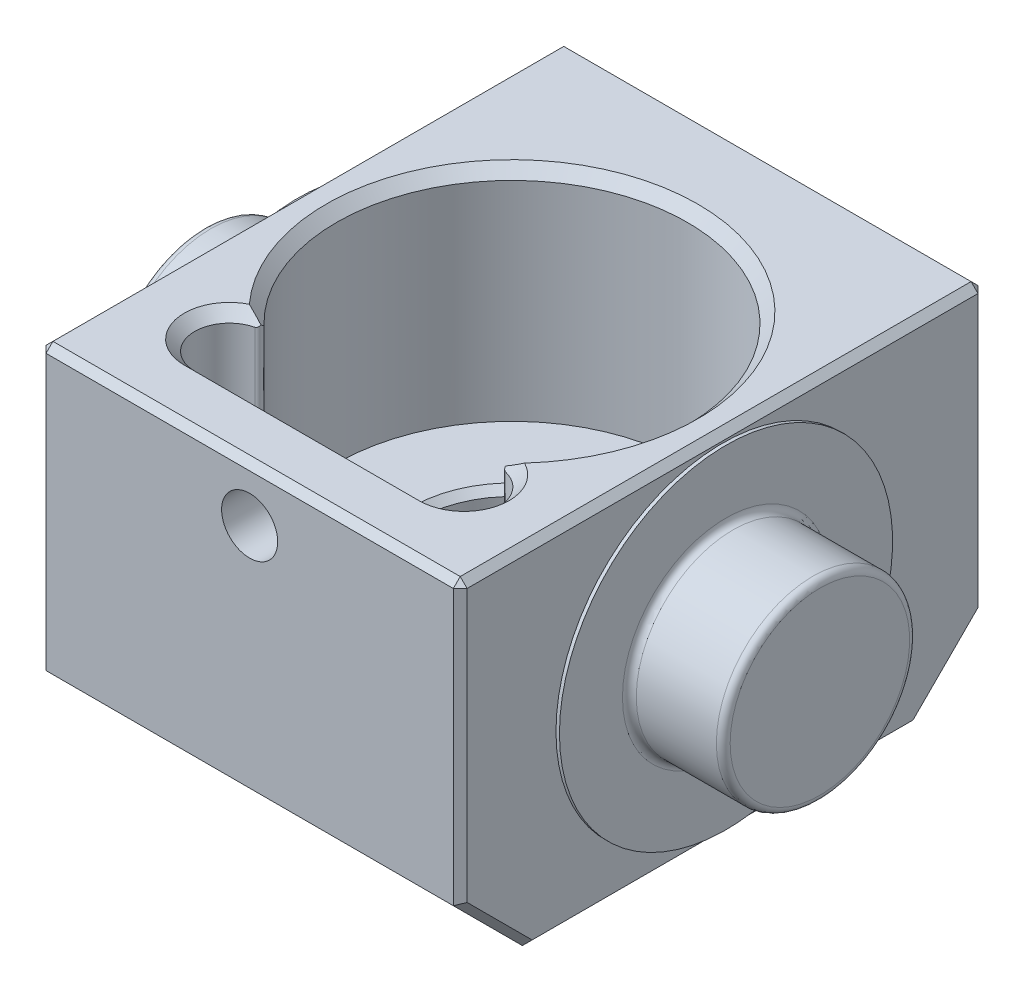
ISO-10303-21;
HEADER;
FILE_DESCRIPTION(('STEP AP214'),'2;1');
FILE_NAME('part.step','',(''),(''),'','','');
FILE_SCHEMA(('AUTOMOTIVE_DESIGN { 1 0 10303 214 1 1 1 1 }'));
ENDSEC;
DATA;
#1=APPLICATION_CONTEXT('core data for automotive mechanical design processes');
#2=APPLICATION_PROTOCOL_DEFINITION('international standard','automotive_design',2000,#1);
#3=PRODUCT_CONTEXT('',#1,'mechanical');
#4=PRODUCT('Part','Part','',(#3));
#5=PRODUCT_RELATED_PRODUCT_CATEGORY('part','',(#4));
#6=PRODUCT_DEFINITION_FORMATION('','',#4);
#7=PRODUCT_DEFINITION_CONTEXT('part definition',#1,'design');
#8=PRODUCT_DEFINITION('design','',#6,#7);
#9=PRODUCT_DEFINITION_SHAPE('','',#8);
#10=(LENGTH_UNIT() NAMED_UNIT(*) SI_UNIT(.MILLI.,.METRE.));
#11=(NAMED_UNIT(*) PLANE_ANGLE_UNIT() SI_UNIT($,.RADIAN.));
#12=(NAMED_UNIT(*) SI_UNIT($,.STERADIAN.) SOLID_ANGLE_UNIT());
#13=UNCERTAINTY_MEASURE_WITH_UNIT(LENGTH_MEASURE(1.E-05),#10,'distance_accuracy_value','');
#14=(GEOMETRIC_REPRESENTATION_CONTEXT(3) GLOBAL_UNCERTAINTY_ASSIGNED_CONTEXT((#13)) GLOBAL_UNIT_ASSIGNED_CONTEXT((#10,
#11,#12)) REPRESENTATION_CONTEXT('',''));
#15=CARTESIAN_POINT('',(0.,0.,0.));
#16=DIRECTION('',(0.,0.,1.));
#17=DIRECTION('',(1.,0.,0.));
#18=AXIS2_PLACEMENT_3D('',#15,#16,#17);
#19=CARTESIAN_POINT('',(-15.25,0.,0.));
#20=DIRECTION('',(1.,0.,0.));
#21=DIRECTION('',(0.,0.,-1.));
#22=AXIS2_PLACEMENT_3D('',#19,#20,#21);
#23=PLANE('',#22);
#24=DIRECTION('',(0.,0.707106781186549,0.707106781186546));
#25=VECTOR('',#24,1.);
#26=CARTESIAN_POINT('',(-15.25,-7.34644660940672,18.6464466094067));
#27=LINE('',#26,#25);
#28=CARTESIAN_POINT('',(-15.25,-12.2,13.7928932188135));
#29=VERTEX_POINT('',#28);
#30=CARTESIAN_POINT('',(-15.25,-7.49289321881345,18.5));
#31=VERTEX_POINT('',#30);
#32=EDGE_CURVE('E289',#29,#31,#27,.T.);
#33=ORIENTED_EDGE('',*,*,#32,.T.);
#34=DIRECTION('',(0.,1.,0.));
#35=VECTOR('',#34,1.);
#36=CARTESIAN_POINT('',(-15.25,0.,18.5));
#37=LINE('',#36,#35);
#38=CARTESIAN_POINT('',(-15.25,12.2,18.5));
#39=VERTEX_POINT('',#38);
#40=EDGE_CURVE('E291',#31,#39,#37,.T.);
#41=ORIENTED_EDGE('',*,*,#40,.T.);
#42=DIRECTION('',(0.,0.,-1.));
#43=VECTOR('',#42,1.);
#44=CARTESIAN_POINT('',(-15.25,12.2,0.));
#45=LINE('',#44,#43);
#46=CARTESIAN_POINT('',(-15.25,12.2,-18.5));
#47=VERTEX_POINT('',#46);
#48=EDGE_CURVE('E281',#39,#47,#45,.T.);
#49=ORIENTED_EDGE('',*,*,#48,.T.);
#50=DIRECTION('',(0.,-1.,0.));
#51=VECTOR('',#50,1.);
#52=CARTESIAN_POINT('',(-15.25,0.,-18.5));
#53=LINE('',#52,#51);
#54=CARTESIAN_POINT('',(-15.25,-7.49289321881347,-18.5));
#55=VERTEX_POINT('',#54);
#56=EDGE_CURVE('E283',#47,#55,#53,.T.);
#57=ORIENTED_EDGE('',*,*,#56,.T.);
#58=DIRECTION('',(0.,-0.707106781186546,0.707106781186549));
#59=VECTOR('',#58,1.);
#60=CARTESIAN_POINT('',(-15.25,-12.3464466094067,-13.6464466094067));
#61=LINE('',#60,#59);
#62=CARTESIAN_POINT('',(-15.25,-12.2,-13.7928932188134));
#63=VERTEX_POINT('',#62);
#64=EDGE_CURVE('E285',#55,#63,#61,.T.);
#65=ORIENTED_EDGE('',*,*,#64,.T.);
#66=DIRECTION('',(0.,0.,1.));
#67=VECTOR('',#66,1.);
#68=CARTESIAN_POINT('',(-15.25,-12.2,0.));
#69=LINE('',#68,#67);
#70=EDGE_CURVE('E287',#63,#29,#69,.T.);
#71=ORIENTED_EDGE('',*,*,#70,.T.);
#72=EDGE_LOOP('',(#33,#41,#49,#57,#65,#71));
#73=FACE_BOUND('',#72,.T.);
#74=CARTESIAN_POINT('',(-15.25,0.,0.));
#75=DIRECTION('',(1.,0.,0.));
#76=DIRECTION('',(0.,0.,-1.));
#77=AXIS2_PLACEMENT_3D('',#74,#75,#76);
#78=CIRCLE('',#77,12.065);
#79=CARTESIAN_POINT('',(-15.25,0.,-12.065));
#80=VERTEX_POINT('',#79);
#81=EDGE_CURVE('E226',#80,#80,#78,.F.);
#82=ORIENTED_EDGE('',*,*,#81,.F.);
#83=EDGE_LOOP('',(#82));
#84=FACE_BOUND('',#83,.T.);
#85=ADVANCED_FACE('F32',(#73,#84),#23,.F.);
#86=CARTESIAN_POINT('',(15.25,0.,0.));
#87=DIRECTION('',(1.,0.,0.));
#88=DIRECTION('',(0.,0.,-1.));
#89=AXIS2_PLACEMENT_3D('',#86,#87,#88);
#90=PLANE('',#89);
#91=DIRECTION('',(0.,-1.,0.));
#92=VECTOR('',#91,1.);
#93=CARTESIAN_POINT('',(15.25,-7.69999999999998,18.5));
#94=LINE('',#93,#92);
#95=CARTESIAN_POINT('',(15.25,12.2,18.5));
#96=VERTEX_POINT('',#95);
#97=CARTESIAN_POINT('',(15.25,-7.49289321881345,18.5));
#98=VERTEX_POINT('',#97);
#99=EDGE_CURVE('E251',#96,#98,#94,.T.);
#100=ORIENTED_EDGE('',*,*,#99,.T.);
#101=DIRECTION('',(0.,-0.707106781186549,-0.707106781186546));
#102=VECTOR('',#101,1.);
#103=CARTESIAN_POINT('',(15.25,-12.9964466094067,12.9964466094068));
#104=LINE('',#103,#102);
#105=CARTESIAN_POINT('',(15.25,-12.2,13.7928932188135));
#106=VERTEX_POINT('',#105);
#107=EDGE_CURVE('E253',#98,#106,#104,.T.);
#108=ORIENTED_EDGE('',*,*,#107,.T.);
#109=DIRECTION('',(0.,0.,-1.));
#110=VECTOR('',#109,1.);
#111=CARTESIAN_POINT('',(15.25,-12.2,-14.));
#112=LINE('',#111,#110);
#113=CARTESIAN_POINT('',(15.25,-12.2,-13.7928932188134));
#114=VERTEX_POINT('',#113);
#115=EDGE_CURVE('E249',#106,#114,#112,.T.);
#116=ORIENTED_EDGE('',*,*,#115,.T.);
#117=DIRECTION('',(0.,0.707106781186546,-0.707106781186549));
#118=VECTOR('',#117,1.);
#119=CARTESIAN_POINT('',(15.25,-12.9964466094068,-12.9964466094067));
#120=LINE('',#119,#118);
#121=CARTESIAN_POINT('',(15.25,-7.49289321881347,-18.5));
#122=VERTEX_POINT('',#121);
#123=EDGE_CURVE('E247',#114,#122,#120,.T.);
#124=ORIENTED_EDGE('',*,*,#123,.T.);
#125=DIRECTION('',(0.,1.,0.));
#126=VECTOR('',#125,1.);
#127=CARTESIAN_POINT('',(15.25,12.7,-18.5));
#128=LINE('',#127,#126);
#129=CARTESIAN_POINT('',(15.25,12.2,-18.5));
#130=VERTEX_POINT('',#129);
#131=EDGE_CURVE('E245',#122,#130,#128,.T.);
#132=ORIENTED_EDGE('',*,*,#131,.T.);
#133=DIRECTION('',(0.,0.,1.));
#134=VECTOR('',#133,1.);
#135=CARTESIAN_POINT('',(15.25,12.2,19.));
#136=LINE('',#135,#134);
#137=EDGE_CURVE('E243',#130,#96,#136,.T.);
#138=ORIENTED_EDGE('',*,*,#137,.T.);
#139=EDGE_LOOP('',(#100,#108,#116,#124,#132,#138));
#140=FACE_BOUND('',#139,.T.);
#141=CARTESIAN_POINT('',(15.25,0.,0.));
#142=DIRECTION('',(-1.,0.,0.));
#143=DIRECTION('',(0.,0.,1.));
#144=AXIS2_PLACEMENT_3D('',#141,#142,#143);
#145=CIRCLE('',#144,12.065);
#146=CARTESIAN_POINT('',(15.25,0.,12.065));
#147=VERTEX_POINT('',#146);
#148=EDGE_CURVE('E223',#147,#147,#145,.T.);
#149=ORIENTED_EDGE('',*,*,#148,.T.);
#150=EDGE_LOOP('',(#149));
#151=FACE_BOUND('',#150,.T.);
#152=ADVANCED_FACE('F508',(#140,#151),#90,.T.);
#153=CARTESIAN_POINT('',(15.25,12.7,-19.));
#154=DIRECTION('',(0.,0.,1.));
#155=DIRECTION('',(0.,-1.,0.));
#156=AXIS2_PLACEMENT_3D('',#153,#154,#155);
#157=PLANE('',#156);
#158=DIRECTION('',(1.,0.,0.));
#159=VECTOR('',#158,1.);
#160=CARTESIAN_POINT('',(15.25,12.2,-19.));
#161=LINE('',#160,#159);
#162=CARTESIAN_POINT('',(-14.75,12.2,-19.));
#163=VERTEX_POINT('',#162);
#164=CARTESIAN_POINT('',(14.75,12.2,-19.));
#165=VERTEX_POINT('',#164);
#166=EDGE_CURVE('E275',#163,#165,#161,.T.);
#167=ORIENTED_EDGE('',*,*,#166,.T.);
#168=DIRECTION('',(0.,-1.,0.));
#169=VECTOR('',#168,1.);
#170=CARTESIAN_POINT('',(14.75,-7.70000000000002,-19.));
#171=LINE('',#170,#169);
#172=CARTESIAN_POINT('',(14.75,-7.70000000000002,-19.));
#173=VERTEX_POINT('',#172);
#174=EDGE_CURVE('E279',#165,#173,#171,.T.);
#175=ORIENTED_EDGE('',*,*,#174,.T.);
#176=DIRECTION('',(-1.,0.,0.));
#177=VECTOR('',#176,1.);
#178=CARTESIAN_POINT('',(15.25,-7.70000000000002,-19.));
#179=LINE('',#178,#177);
#180=CARTESIAN_POINT('',(-14.75,-7.70000000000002,-19.));
#181=VERTEX_POINT('',#180);
#182=EDGE_CURVE('E231',#173,#181,#179,.T.);
#183=ORIENTED_EDGE('',*,*,#182,.T.);
#184=DIRECTION('',(0.,1.,0.));
#185=VECTOR('',#184,1.);
#186=CARTESIAN_POINT('',(-14.75,12.7,-19.));
#187=LINE('',#186,#185);
#188=EDGE_CURVE('E277',#181,#163,#187,.T.);
#189=ORIENTED_EDGE('',*,*,#188,.T.);
#190=EDGE_LOOP('',(#167,#175,#183,#189));
#191=FACE_BOUND('',#190,.T.);
#192=ADVANCED_FACE('F514',(#191),#157,.F.);
#193=CARTESIAN_POINT('',(15.25,12.7,19.));
#194=DIRECTION('',(0.,-1.,0.));
#195=DIRECTION('',(0.,0.,-1.));
#196=AXIS2_PLACEMENT_3D('',#193,#194,#195);
#197=PLANE('',#196);
#198=CARTESIAN_POINT('',(8.50000000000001,12.7,11.97293));
#199=DIRECTION('',(0.,-1.,0.));
#200=DIRECTION('',(0.,0.,-1.));
#201=AXIS2_PLACEMENT_3D('',#198,#199,#200);
#202=CIRCLE('',#201,3.26200000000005);
#203=CARTESIAN_POINT('',(9.96403545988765,12.7,9.05792671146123));
#204=VERTEX_POINT('',#203);
#205=CARTESIAN_POINT('',(8.50000000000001,12.7,15.2349300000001));
#206=VERTEX_POINT('',#205);
#207=EDGE_CURVE('E367',#204,#206,#202,.T.);
#208=ORIENTED_EDGE('',*,*,#207,.T.);
#209=DIRECTION('',(-1.,0.,0.));
#210=VECTOR('',#209,1.);
#211=CARTESIAN_POINT('',(15.25,12.7,15.2349300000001));
#212=LINE('',#211,#210);
#213=CARTESIAN_POINT('',(-8.50000000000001,12.7,15.2349300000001));
#214=VERTEX_POINT('',#213);
#215=EDGE_CURVE('E369',#206,#214,#212,.T.);
#216=ORIENTED_EDGE('',*,*,#215,.T.);
#217=CARTESIAN_POINT('',(-8.50000000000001,12.7,11.97293));
#218=DIRECTION('',(0.,-1.,0.));
#219=DIRECTION('',(0.,0.,-1.));
#220=AXIS2_PLACEMENT_3D('',#217,#218,#219);
#221=CIRCLE('',#220,3.26200000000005);
#222=CARTESIAN_POINT('',(-9.96403545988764,12.7,9.05792671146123));
#223=VERTEX_POINT('',#222);
#224=EDGE_CURVE('E362',#214,#223,#221,.T.);
#225=ORIENTED_EDGE('',*,*,#224,.T.);
#226=CARTESIAN_POINT('',(0.,12.7,0.));
#227=DIRECTION('',(0.,-1.,0.));
#228=DIRECTION('',(0.,0.,-1.));
#229=AXIS2_PLACEMENT_3D('',#226,#227,#228);
#230=CIRCLE('',#229,13.46581);
#231=EDGE_CURVE('E365',#223,#204,#230,.T.);
#232=ORIENTED_EDGE('',*,*,#231,.T.);
#233=EDGE_LOOP('',(#208,#216,#225,#232));
#234=FACE_BOUND('',#233,.T.);
#235=DIRECTION('',(0.,0.,-1.));
#236=VECTOR('',#235,1.);
#237=CARTESIAN_POINT('',(14.75,12.7,-19.));
#238=LINE('',#237,#236);
#239=CARTESIAN_POINT('',(14.75,12.7,18.5));
#240=VERTEX_POINT('',#239);
#241=CARTESIAN_POINT('',(14.75,12.7,-18.5));
#242=VERTEX_POINT('',#241);
#243=EDGE_CURVE('E298',#240,#242,#238,.T.);
#244=ORIENTED_EDGE('',*,*,#243,.T.);
#245=DIRECTION('',(-1.,0.,0.));
#246=VECTOR('',#245,1.);
#247=CARTESIAN_POINT('',(15.25,12.7,-18.5));
#248=LINE('',#247,#246);
#249=CARTESIAN_POINT('',(-14.75,12.7,-18.5));
#250=VERTEX_POINT('',#249);
#251=EDGE_CURVE('E300',#242,#250,#248,.T.);
#252=ORIENTED_EDGE('',*,*,#251,.T.);
#253=DIRECTION('',(0.,0.,1.));
#254=VECTOR('',#253,1.);
#255=CARTESIAN_POINT('',(-14.75,12.7,19.));
#256=LINE('',#255,#254);
#257=CARTESIAN_POINT('',(-14.75,12.7,18.5));
#258=VERTEX_POINT('',#257);
#259=EDGE_CURVE('E294',#250,#258,#256,.T.);
#260=ORIENTED_EDGE('',*,*,#259,.T.);
#261=DIRECTION('',(1.,0.,0.));
#262=VECTOR('',#261,1.);
#263=CARTESIAN_POINT('',(15.25,12.7,18.5));
#264=LINE('',#263,#262);
#265=EDGE_CURVE('E296',#258,#240,#264,.T.);
#266=ORIENTED_EDGE('',*,*,#265,.T.);
#267=EDGE_LOOP('',(#244,#252,#260,#266));
#268=FACE_BOUND('',#267,.T.);
#269=ADVANCED_FACE('F528',(#234,#268),#197,.F.);
#270=CARTESIAN_POINT('',(15.25,12.7,19.));
#271=DIRECTION('',(0.,0.,-1.));
#272=DIRECTION('',(0.,1.,0.));
#273=AXIS2_PLACEMENT_3D('',#270,#271,#272);
#274=PLANE('',#273);
#275=CARTESIAN_POINT('',(0.,8.76,19.));
#276=DIRECTION('',(0.,0.,1.));
#277=DIRECTION('',(1.,0.,0.));
#278=AXIS2_PLACEMENT_3D('',#275,#276,#277);
#279=CIRCLE('',#278,2.032);
#280=CARTESIAN_POINT('',(2.032,8.76,19.));
#281=VERTEX_POINT('',#280);
#282=EDGE_CURVE('E383',#281,#281,#279,.T.);
#283=ORIENTED_EDGE('',*,*,#282,.F.);
#284=EDGE_LOOP('',(#283));
#285=FACE_BOUND('',#284,.T.);
#286=DIRECTION('',(1.,0.,0.));
#287=VECTOR('',#286,1.);
#288=CARTESIAN_POINT('',(15.25,-7.69999999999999,19.));
#289=LINE('',#288,#287);
#290=CARTESIAN_POINT('',(-14.75,-7.69999999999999,19.));
#291=VERTEX_POINT('',#290);
#292=CARTESIAN_POINT('',(14.75,-7.69999999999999,19.));
#293=VERTEX_POINT('',#292);
#294=EDGE_CURVE('E240',#291,#293,#289,.T.);
#295=ORIENTED_EDGE('',*,*,#294,.T.);
#296=DIRECTION('',(0.,1.,0.));
#297=VECTOR('',#296,1.);
#298=CARTESIAN_POINT('',(14.75,12.7,19.));
#299=LINE('',#298,#297);
#300=CARTESIAN_POINT('',(14.75,12.2,19.));
#301=VERTEX_POINT('',#300);
#302=EDGE_CURVE('E265',#293,#301,#299,.T.);
#303=ORIENTED_EDGE('',*,*,#302,.T.);
#304=DIRECTION('',(-1.,0.,0.));
#305=VECTOR('',#304,1.);
#306=CARTESIAN_POINT('',(15.25,12.2,19.));
#307=LINE('',#306,#305);
#308=CARTESIAN_POINT('',(-14.75,12.2,19.));
#309=VERTEX_POINT('',#308);
#310=EDGE_CURVE('E261',#301,#309,#307,.T.);
#311=ORIENTED_EDGE('',*,*,#310,.T.);
#312=DIRECTION('',(0.,-1.,0.));
#313=VECTOR('',#312,1.);
#314=CARTESIAN_POINT('',(-14.75,12.7,19.));
#315=LINE('',#314,#313);
#316=EDGE_CURVE('E263',#309,#291,#315,.T.);
#317=ORIENTED_EDGE('',*,*,#316,.T.);
#318=EDGE_LOOP('',(#295,#303,#311,#317));
#319=FACE_BOUND('',#318,.T.);
#320=ADVANCED_FACE('F524',(#285,#319),#274,.F.);
#321=CARTESIAN_POINT('',(15.25,-12.7,19.));
#322=DIRECTION('',(0.,1.,0.));
#323=DIRECTION('',(0.,0.,1.));
#324=AXIS2_PLACEMENT_3D('',#321,#322,#323);
#325=PLANE('',#324);
#326=CARTESIAN_POINT('',(0.,-12.7,0.));
#327=DIRECTION('',(0.,1.,0.));
#328=DIRECTION('',(0.,0.,1.));
#329=AXIS2_PLACEMENT_3D('',#326,#327,#328);
#330=CIRCLE('',#329,10.8251);
#331=CARTESIAN_POINT('',(0.,-12.7,10.8251));
#332=VERTEX_POINT('',#331);
#333=EDGE_CURVE('E465',#332,#332,#330,.T.);
#334=ORIENTED_EDGE('',*,*,#333,.T.);
#335=EDGE_LOOP('',(#334));
#336=FACE_BOUND('',#335,.T.);
#337=DIRECTION('',(1.,0.,0.));
#338=VECTOR('',#337,1.);
#339=CARTESIAN_POINT('',(15.25,-12.7,-14.));
#340=LINE('',#339,#338);
#341=CARTESIAN_POINT('',(-14.75,-12.7,-14.));
#342=VERTEX_POINT('',#341);
#343=CARTESIAN_POINT('',(14.75,-12.7,-14.));
#344=VERTEX_POINT('',#343);
#345=EDGE_CURVE('E237',#342,#344,#340,.T.);
#346=ORIENTED_EDGE('',*,*,#345,.T.);
#347=DIRECTION('',(0.,0.,1.));
#348=VECTOR('',#347,1.);
#349=CARTESIAN_POINT('',(14.75,-12.7,14.));
#350=LINE('',#349,#348);
#351=CARTESIAN_POINT('',(14.75,-12.7,14.));
#352=VERTEX_POINT('',#351);
#353=EDGE_CURVE('E269',#344,#352,#350,.T.);
#354=ORIENTED_EDGE('',*,*,#353,.T.);
#355=DIRECTION('',(-1.,0.,0.));
#356=VECTOR('',#355,1.);
#357=CARTESIAN_POINT('',(15.25,-12.7,14.));
#358=LINE('',#357,#356);
#359=CARTESIAN_POINT('',(-14.75,-12.7,14.));
#360=VERTEX_POINT('',#359);
#361=EDGE_CURVE('E234',#352,#360,#358,.T.);
#362=ORIENTED_EDGE('',*,*,#361,.T.);
#363=DIRECTION('',(0.,0.,-1.));
#364=VECTOR('',#363,1.);
#365=CARTESIAN_POINT('',(-14.75,-12.7,19.));
#366=LINE('',#365,#364);
#367=EDGE_CURVE('E267',#360,#342,#366,.T.);
#368=ORIENTED_EDGE('',*,*,#367,.T.);
#369=EDGE_LOOP('',(#346,#354,#362,#368));
#370=FACE_BOUND('',#369,.T.);
#371=ADVANCED_FACE('F520',(#336,#370),#325,.F.);
#372=CARTESIAN_POINT('',(0.,0.,0.));
#373=DIRECTION('',(-1.,0.,0.));
#374=DIRECTION('',(0.,0.,1.));
#375=AXIS2_PLACEMENT_3D('',#372,#373,#374);
#376=CYLINDRICAL_SURFACE('',#375,12.065);
#377=ORIENTED_EDGE('',*,*,#148,.F.);
#378=EDGE_LOOP('',(#377));
#379=FACE_BOUND('',#378,.T.);
#380=CARTESIAN_POINT('',(15.5,0.,0.));
#381=DIRECTION('',(-1.,0.,0.));
#382=DIRECTION('',(0.,0.,1.));
#383=AXIS2_PLACEMENT_3D('',#380,#381,#382);
#384=CIRCLE('',#383,12.065);
#385=CARTESIAN_POINT('',(15.5,0.,12.065));
#386=VERTEX_POINT('',#385);
#387=EDGE_CURVE('E220',#386,#386,#384,.T.);
#388=ORIENTED_EDGE('',*,*,#387,.T.);
#389=EDGE_LOOP('',(#388));
#390=FACE_BOUND('',#389,.T.);
#391=ADVANCED_FACE('F523',(#379,#390),#376,.T.);
#392=CARTESIAN_POINT('',(15.5,12.065,0.));
#393=DIRECTION('',(-1.,0.,0.));
#394=DIRECTION('',(0.,0.,1.));
#395=AXIS2_PLACEMENT_3D('',#392,#393,#394);
#396=PLANE('',#395);
#397=CARTESIAN_POINT('',(15.5,0.,0.));
#398=DIRECTION('',(-1.,0.,0.));
#399=DIRECTION('',(0.,0.,1.));
#400=AXIS2_PLACEMENT_3D('',#397,#398,#399);
#401=CIRCLE('',#400,7.500000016);
#402=CARTESIAN_POINT('',(15.5,0.,7.500000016));
#403=VERTEX_POINT('',#402);
#404=EDGE_CURVE('E483',#403,#403,#401,.T.);
#405=ORIENTED_EDGE('',*,*,#404,.T.);
#406=EDGE_LOOP('',(#405));
#407=FACE_BOUND('',#406,.T.);
#408=ORIENTED_EDGE('',*,*,#387,.F.);
#409=EDGE_LOOP('',(#408));
#410=FACE_BOUND('',#409,.T.);
#411=ADVANCED_FACE('F746',(#407,#410),#396,.F.);
#412=CARTESIAN_POINT('',(0.,0.,0.));
#413=DIRECTION('',(-1.,0.,0.));
#414=DIRECTION('',(0.,0.,1.));
#415=AXIS2_PLACEMENT_3D('',#412,#413,#414);
#416=CYLINDRICAL_SURFACE('',#415,7.);
#417=CARTESIAN_POINT('',(16.000000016,0.,0.));
#418=DIRECTION('',(-1.,0.,0.));
#419=DIRECTION('',(0.,0.,1.));
#420=AXIS2_PLACEMENT_3D('',#417,#418,#419);
#421=CIRCLE('',#420,7.);
#422=CARTESIAN_POINT('',(16.000000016,0.,7.));
#423=VERTEX_POINT('',#422);
#424=EDGE_CURVE('E486',#423,#423,#421,.F.);
#425=ORIENTED_EDGE('',*,*,#424,.T.);
#426=EDGE_LOOP('',(#425));
#427=FACE_BOUND('',#426,.T.);
#428=CARTESIAN_POINT('',(21.799999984,0.,0.));
#429=DIRECTION('',(-1.,0.,0.));
#430=DIRECTION('',(0.,0.,1.));
#431=AXIS2_PLACEMENT_3D('',#428,#429,#430);
#432=CIRCLE('',#431,7.);
#433=CARTESIAN_POINT('',(21.799999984,0.,7.));
#434=VERTEX_POINT('',#433);
#435=EDGE_CURVE('E477',#434,#434,#432,.T.);
#436=ORIENTED_EDGE('',*,*,#435,.T.);
#437=EDGE_LOOP('',(#436));
#438=FACE_BOUND('',#437,.T.);
#439=ADVANCED_FACE('F743',(#427,#438),#416,.T.);
#440=CARTESIAN_POINT('',(22.3,7.,0.));
#441=DIRECTION('',(-1.,0.,0.));
#442=DIRECTION('',(0.,0.,1.));
#443=AXIS2_PLACEMENT_3D('',#440,#441,#442);
#444=PLANE('',#443);
#445=CARTESIAN_POINT('',(22.3,0.,0.));
#446=DIRECTION('',(-1.,0.,0.));
#447=DIRECTION('',(0.,0.,1.));
#448=AXIS2_PLACEMENT_3D('',#445,#446,#447);
#449=CIRCLE('',#448,6.499999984);
#450=CARTESIAN_POINT('',(22.3,0.,6.499999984));
#451=VERTEX_POINT('',#450);
#452=EDGE_CURVE('E480',#451,#451,#449,.F.);
#453=ORIENTED_EDGE('',*,*,#452,.T.);
#454=EDGE_LOOP('',(#453));
#455=FACE_BOUND('',#454,.T.);
#456=ADVANCED_FACE('F745',(#455),#444,.F.);
#457=CARTESIAN_POINT('',(0.,0.,0.));
#458=DIRECTION('',(1.,0.,0.));
#459=DIRECTION('',(0.,0.,1.));
#460=AXIS2_PLACEMENT_3D('',#457,#458,#459);
#461=CYLINDRICAL_SURFACE('',#460,12.065);
#462=ORIENTED_EDGE('',*,*,#81,.T.);
#463=EDGE_LOOP('',(#462));
#464=FACE_BOUND('',#463,.T.);
#465=CARTESIAN_POINT('',(-15.5,0.,0.));
#466=DIRECTION('',(-1.,0.,0.));
#467=DIRECTION('',(0.,0.,1.));
#468=AXIS2_PLACEMENT_3D('',#465,#466,#467);
#469=CIRCLE('',#468,12.065);
#470=CARTESIAN_POINT('',(-15.5,0.,12.065));
#471=VERTEX_POINT('',#470);
#472=EDGE_CURVE('E217',#471,#471,#469,.T.);
#473=ORIENTED_EDGE('',*,*,#472,.F.);
#474=EDGE_LOOP('',(#473));
#475=FACE_BOUND('',#474,.T.);
#476=ADVANCED_FACE('F753',(#464,#475),#461,.T.);
#477=CARTESIAN_POINT('',(-15.5,12.065,0.));
#478=DIRECTION('',(1.,0.,0.));
#479=DIRECTION('',(0.,0.,1.));
#480=AXIS2_PLACEMENT_3D('',#477,#478,#479);
#481=PLANE('',#480);
#482=CARTESIAN_POINT('',(-15.5,0.,0.));
#483=DIRECTION('',(1.,0.,0.));
#484=DIRECTION('',(0.,0.,-1.));
#485=AXIS2_PLACEMENT_3D('',#482,#483,#484);
#486=CIRCLE('',#485,7.500000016);
#487=CARTESIAN_POINT('',(-15.5,0.,-7.500000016));
#488=VERTEX_POINT('',#487);
#489=EDGE_CURVE('E11',#488,#488,#486,.T.);
#490=ORIENTED_EDGE('',*,*,#489,.T.);
#491=EDGE_LOOP('',(#490));
#492=FACE_BOUND('',#491,.T.);
#493=ORIENTED_EDGE('',*,*,#472,.T.);
#494=EDGE_LOOP('',(#493));
#495=FACE_BOUND('',#494,.T.);
#496=ADVANCED_FACE('F794',(#492,#495),#481,.F.);
#497=CARTESIAN_POINT('',(0.,0.,0.));
#498=DIRECTION('',(1.,0.,0.));
#499=DIRECTION('',(0.,0.,1.));
#500=AXIS2_PLACEMENT_3D('',#497,#498,#499);
#501=CYLINDRICAL_SURFACE('',#500,7.);
#502=CARTESIAN_POINT('',(-16.000000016,0.,0.));
#503=DIRECTION('',(1.,0.,0.));
#504=DIRECTION('',(0.,0.,-1.));
#505=AXIS2_PLACEMENT_3D('',#502,#503,#504);
#506=CIRCLE('',#505,7.);
#507=CARTESIAN_POINT('',(-16.000000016,0.,-7.));
#508=VERTEX_POINT('',#507);
#509=EDGE_CURVE('E40',#508,#508,#506,.F.);
#510=ORIENTED_EDGE('',*,*,#509,.T.);
#511=EDGE_LOOP('',(#510));
#512=FACE_BOUND('',#511,.T.);
#513=CARTESIAN_POINT('',(-21.799999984,0.,0.));
#514=DIRECTION('',(1.,0.,0.));
#515=DIRECTION('',(0.,0.,-1.));
#516=AXIS2_PLACEMENT_3D('',#513,#514,#515);
#517=CIRCLE('',#516,7.);
#518=CARTESIAN_POINT('',(-21.799999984,0.,-7.));
#519=VERTEX_POINT('',#518);
#520=EDGE_CURVE('E474',#519,#519,#517,.T.);
#521=ORIENTED_EDGE('',*,*,#520,.T.);
#522=EDGE_LOOP('',(#521));
#523=FACE_BOUND('',#522,.T.);
#524=ADVANCED_FACE('F491',(#512,#523),#501,.T.);
#525=CARTESIAN_POINT('',(-22.3,7.,0.));
#526=DIRECTION('',(1.,0.,0.));
#527=DIRECTION('',(0.,0.,1.));
#528=AXIS2_PLACEMENT_3D('',#525,#526,#527);
#529=PLANE('',#528);
#530=CARTESIAN_POINT('',(-22.3,0.,0.));
#531=DIRECTION('',(1.,0.,0.));
#532=DIRECTION('',(0.,0.,-1.));
#533=AXIS2_PLACEMENT_3D('',#530,#531,#532);
#534=CIRCLE('',#533,6.499999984);
#535=CARTESIAN_POINT('',(-22.3,0.,-6.499999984));
#536=VERTEX_POINT('',#535);
#537=EDGE_CURVE('E471',#536,#536,#534,.F.);
#538=ORIENTED_EDGE('',*,*,#537,.T.);
#539=EDGE_LOOP('',(#538));
#540=FACE_BOUND('',#539,.T.);
#541=ADVANCED_FACE('F812',(#540),#529,.F.);
#542=CARTESIAN_POINT('',(0.,-3.175,0.));
#543=DIRECTION('',(0.,-1.,0.));
#544=DIRECTION('',(0.,0.,-1.));
#545=AXIS2_PLACEMENT_3D('',#542,#543,#544);
#546=PLANE('',#545);
#547=CARTESIAN_POINT('',(0.,-3.175,0.));
#548=DIRECTION('',(0.,-1.,0.));
#549=DIRECTION('',(0.,0.,-1.));
#550=AXIS2_PLACEMENT_3D('',#547,#548,#549);
#551=CIRCLE('',#550,7.24370000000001);
#552=CARTESIAN_POINT('',(0.,-3.175,-7.24370000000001));
#553=VERTEX_POINT('',#552);
#554=EDGE_CURVE('E459',#553,#553,#551,.T.);
#555=ORIENTED_EDGE('',*,*,#554,.T.);
#556=EDGE_LOOP('',(#555));
#557=FACE_BOUND('',#556,.T.);
#558=CARTESIAN_POINT('',(0.,-3.175,0.));
#559=DIRECTION('',(0.,1.,0.));
#560=DIRECTION('',(0.,0.,1.));
#561=AXIS2_PLACEMENT_3D('',#558,#559,#560);
#562=CIRCLE('',#561,12.70381);
#563=CARTESIAN_POINT('',(0.,-3.175,12.70381));
#564=VERTEX_POINT('',#563);
#565=EDGE_CURVE('E214',#564,#564,#562,.T.);
#566=ORIENTED_EDGE('',*,*,#565,.T.);
#567=EDGE_LOOP('',(#566));
#568=FACE_BOUND('',#567,.T.);
#569=ADVANCED_FACE('F821',(#557,#568),#546,.F.);
#570=CARTESIAN_POINT('',(0.,10.1246822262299,0.));
#571=DIRECTION('',(0.,1.,0.));
#572=DIRECTION('',(0.,0.,1.));
#573=AXIS2_PLACEMENT_3D('',#570,#571,#572);
#574=CYLINDRICAL_SURFACE('',#573,12.70381);
#575=CARTESIAN_POINT('',(0.,6.2,0.));
#576=DIRECTION('',(0.,1.,0.));
#577=DIRECTION('',(0.,0.,1.));
#578=AXIS2_PLACEMENT_3D('',#575,#576,#577);
#579=CIRCLE('',#578,12.70381);
#580=CARTESIAN_POINT('',(8.93136026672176,6.2,9.03424553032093));
#581=VERTEX_POINT('',#580);
#582=CARTESIAN_POINT('',(-8.93136026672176,6.2,9.03424553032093));
#583=VERTEX_POINT('',#582);
#584=EDGE_CURVE('E229',#581,#583,#579,.F.);
#585=ORIENTED_EDGE('',*,*,#584,.F.);
#586=DIRECTION('',(0.,1.,0.));
#587=VECTOR('',#586,1.);
#588=CARTESIAN_POINT('',(8.93136026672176,10.1246822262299,9.03424553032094));
#589=LINE('',#588,#587);
#590=CARTESIAN_POINT('',(8.93136026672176,11.938,9.03424553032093));
#591=VERTEX_POINT('',#590);
#592=EDGE_CURVE('E637',#581,#591,#589,.T.);
#593=ORIENTED_EDGE('',*,*,#592,.T.);
#594=CARTESIAN_POINT('',(0.,11.938,0.));
#595=DIRECTION('',(0.,-1.,0.));
#596=DIRECTION('',(0.,0.,-1.));
#597=AXIS2_PLACEMENT_3D('',#594,#595,#596);
#598=CIRCLE('',#597,12.70381);
#599=CARTESIAN_POINT('',(-8.93136026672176,11.938,9.03424553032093));
#600=VERTEX_POINT('',#599);
#601=EDGE_CURVE('E375',#591,#600,#598,.F.);
#602=ORIENTED_EDGE('',*,*,#601,.T.);
#603=DIRECTION('',(0.,1.,0.));
#604=VECTOR('',#603,1.);
#605=CARTESIAN_POINT('',(-8.93136026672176,10.1246822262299,9.03424553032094));
#606=LINE('',#605,#604);
#607=EDGE_CURVE('E379',#600,#583,#606,.F.);
#608=ORIENTED_EDGE('',*,*,#607,.T.);
#609=EDGE_LOOP('',(#585,#593,#602,#608));
#610=FACE_BOUND('',#609,.T.);
#611=ORIENTED_EDGE('',*,*,#565,.F.);
#612=EDGE_LOOP('',(#611));
#613=FACE_BOUND('',#612,.T.);
#614=ADVANCED_FACE('F642',(#610,#613),#574,.F.);
#615=CARTESIAN_POINT('',(0.,-1.92521317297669,0.));
#616=DIRECTION('',(0.,1.,0.));
#617=DIRECTION('',(0.,0.,1.));
#618=AXIS2_PLACEMENT_3D('',#615,#616,#617);
#619=CYLINDRICAL_SURFACE('',#618,6.7437);
#620=CARTESIAN_POINT('',(0.,-3.675,0.));
#621=DIRECTION('',(0.,-1.,0.));
#622=DIRECTION('',(0.,0.,-1.));
#623=AXIS2_PLACEMENT_3D('',#620,#621,#622);
#624=CIRCLE('',#623,6.7437);
#625=CARTESIAN_POINT('',(0.,-3.675,-6.7437));
#626=VERTEX_POINT('',#625);
#627=EDGE_CURVE('E456',#626,#626,#624,.F.);
#628=ORIENTED_EDGE('',*,*,#627,.T.);
#629=EDGE_LOOP('',(#628));
#630=FACE_BOUND('',#629,.T.);
#631=CARTESIAN_POINT('',(0.,-9.025,0.));
#632=DIRECTION('',(0.,1.,0.));
#633=DIRECTION('',(0.,0.,1.));
#634=AXIS2_PLACEMENT_3D('',#631,#632,#633);
#635=CIRCLE('',#634,6.7437);
#636=CARTESIAN_POINT('',(0.,-9.025,6.7437));
#637=VERTEX_POINT('',#636);
#638=EDGE_CURVE('E453',#637,#637,#635,.F.);
#639=ORIENTED_EDGE('',*,*,#638,.T.);
#640=EDGE_LOOP('',(#639));
#641=FACE_BOUND('',#640,.T.);
#642=ADVANCED_FACE('F840',(#630,#641),#619,.F.);
#643=CARTESIAN_POINT('',(-6.7437,-9.525,0.));
#644=DIRECTION('',(0.,1.,0.));
#645=DIRECTION('',(0.,0.,1.));
#646=AXIS2_PLACEMENT_3D('',#643,#644,#645);
#647=PLANE('',#646);
#648=CARTESIAN_POINT('',(0.,-9.525,0.));
#649=DIRECTION('',(0.,1.,0.));
#650=DIRECTION('',(0.,0.,1.));
#651=AXIS2_PLACEMENT_3D('',#648,#649,#650);
#652=CIRCLE('',#651,7.24369999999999);
#653=CARTESIAN_POINT('',(0.,-9.525,7.24369999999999));
#654=VERTEX_POINT('',#653);
#655=EDGE_CURVE('E462',#654,#654,#652,.T.);
#656=ORIENTED_EDGE('',*,*,#655,.T.);
#657=EDGE_LOOP('',(#656));
#658=FACE_BOUND('',#657,.T.);
#659=CARTESIAN_POINT('',(0.,-9.525,0.));
#660=DIRECTION('',(0.,1.,0.));
#661=DIRECTION('',(0.,0.,1.));
#662=AXIS2_PLACEMENT_3D('',#659,#660,#661);
#663=CIRCLE('',#662,10.3251);
#664=CARTESIAN_POINT('',(0.,-9.525,10.3251));
#665=VERTEX_POINT('',#664);
#666=EDGE_CURVE('E210',#665,#665,#663,.T.);
#667=ORIENTED_EDGE('',*,*,#666,.F.);
#668=EDGE_LOOP('',(#667));
#669=FACE_BOUND('',#668,.T.);
#670=ADVANCED_FACE('F849',(#658,#669),#647,.F.);
#671=CARTESIAN_POINT('',(0.,-1.92521317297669,0.));
#672=DIRECTION('',(0.,1.,0.));
#673=DIRECTION('',(0.,0.,1.));
#674=AXIS2_PLACEMENT_3D('',#671,#672,#673);
#675=CYLINDRICAL_SURFACE('',#674,10.3251);
#676=CARTESIAN_POINT('',(0.,-12.2,0.));
#677=DIRECTION('',(0.,1.,0.));
#678=DIRECTION('',(0.,0.,1.));
#679=AXIS2_PLACEMENT_3D('',#676,#677,#678);
#680=CIRCLE('',#679,10.3251);
#681=CARTESIAN_POINT('',(0.,-12.2,10.3251));
#682=VERTEX_POINT('',#681);
#683=EDGE_CURVE('E468',#682,#682,#680,.F.);
#684=ORIENTED_EDGE('',*,*,#683,.T.);
#685=EDGE_LOOP('',(#684));
#686=FACE_BOUND('',#685,.T.);
#687=ORIENTED_EDGE('',*,*,#666,.T.);
#688=EDGE_LOOP('',(#687));
#689=FACE_BOUND('',#688,.T.);
#690=ADVANCED_FACE('F859',(#686,#689),#675,.F.);
#691=CARTESIAN_POINT('',(-8.50000000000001,6.2,11.97293));
#692=DIRECTION('',(0.,1.,0.));
#693=DIRECTION('',(0.,0.,1.));
#694=AXIS2_PLACEMENT_3D('',#691,#692,#693);
#695=PLANE('',#694);
#696=ORIENTED_EDGE('',*,*,#584,.T.);
#697=CARTESIAN_POINT('',(-9.14227400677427,6.2,9.24758890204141));
#698=DIRECTION('',(0.,1.,0.));
#699=DIRECTION('',(0.,0.,1.));
#700=AXIS2_PLACEMENT_3D('',#697,#698,#699);
#701=CIRCLE('',#700,0.3);
#702=CARTESIAN_POINT('',(-9.07345893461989,6.2,9.53958973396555));
#703=VERTEX_POINT('',#702);
#704=EDGE_CURVE('E47',#583,#703,#701,.F.);
#705=ORIENTED_EDGE('',*,*,#704,.T.);
#706=CARTESIAN_POINT('',(-8.50000000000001,6.2,11.97293));
#707=DIRECTION('',(0.,1.,0.));
#708=DIRECTION('',(0.,0.,1.));
#709=AXIS2_PLACEMENT_3D('',#706,#707,#708);
#710=CIRCLE('',#709,2.5);
#711=CARTESIAN_POINT('',(-8.50000000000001,6.2,14.47293));
#712=VERTEX_POINT('',#711);
#713=EDGE_CURVE('E185',#703,#712,#710,.T.);
#714=ORIENTED_EDGE('',*,*,#713,.T.);
#715=DIRECTION('',(1.,0.,0.));
#716=VECTOR('',#715,1.);
#717=CARTESIAN_POINT('',(-8.50000000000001,6.2,14.47293));
#718=LINE('',#717,#716);
#719=CARTESIAN_POINT('',(8.50000000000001,6.2,14.47293));
#720=VERTEX_POINT('',#719);
#721=EDGE_CURVE('E190',#712,#720,#718,.T.);
#722=ORIENTED_EDGE('',*,*,#721,.T.);
#723=CARTESIAN_POINT('',(8.50000000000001,6.2,11.97293));
#724=DIRECTION('',(0.,1.,0.));
#725=DIRECTION('',(0.,0.,1.));
#726=AXIS2_PLACEMENT_3D('',#723,#724,#725);
#727=CIRCLE('',#726,2.5);
#728=CARTESIAN_POINT('',(9.07345893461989,6.2,9.53958973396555));
#729=VERTEX_POINT('',#728);
#730=EDGE_CURVE('E201',#720,#729,#727,.T.);
#731=ORIENTED_EDGE('',*,*,#730,.T.);
#732=CARTESIAN_POINT('',(9.14227400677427,6.2,9.24758890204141));
#733=DIRECTION('',(0.,1.,0.));
#734=DIRECTION('',(0.,0.,1.));
#735=AXIS2_PLACEMENT_3D('',#732,#733,#734);
#736=CIRCLE('',#735,0.3);
#737=EDGE_CURVE('E449',#729,#581,#736,.F.);
#738=ORIENTED_EDGE('',*,*,#737,.T.);
#739=EDGE_LOOP('',(#696,#705,#714,#722,#731,#738));
#740=FACE_BOUND('',#739,.T.);
#741=ADVANCED_FACE('F187',(#740),#695,.T.);
#742=CARTESIAN_POINT('',(-8.50000000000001,6.2,11.97293));
#743=DIRECTION('',(0.,1.,0.));
#744=DIRECTION('',(0.,0.,1.));
#745=AXIS2_PLACEMENT_3D('',#742,#743,#744);
#746=CYLINDRICAL_SURFACE('',#745,2.5);
#747=ORIENTED_EDGE('',*,*,#713,.F.);
#748=DIRECTION('',(0.,1.,0.));
#749=VECTOR('',#748,1.);
#750=CARTESIAN_POINT('',(-9.07345893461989,6.2,9.53958973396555));
#751=LINE('',#750,#749);
#752=CARTESIAN_POINT('',(-9.07345893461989,11.938,9.53958973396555));
#753=VERTEX_POINT('',#752);
#754=EDGE_CURVE('E54',#703,#753,#751,.T.);
#755=ORIENTED_EDGE('',*,*,#754,.T.);
#756=CARTESIAN_POINT('',(-8.50000000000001,11.938,11.97293));
#757=DIRECTION('',(0.,-1.,0.));
#758=DIRECTION('',(0.,0.,-1.));
#759=AXIS2_PLACEMENT_3D('',#756,#757,#758);
#760=CIRCLE('',#759,2.5);
#761=CARTESIAN_POINT('',(-8.50000000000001,11.938,14.47293));
#762=VERTEX_POINT('',#761);
#763=EDGE_CURVE('E196',#753,#762,#760,.F.);
#764=ORIENTED_EDGE('',*,*,#763,.T.);
#765=DIRECTION('',(0.,1.,0.));
#766=VECTOR('',#765,1.);
#767=CARTESIAN_POINT('',(-8.50000000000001,6.2,14.47293));
#768=LINE('',#767,#766);
#769=EDGE_CURVE('E194',#712,#762,#768,.T.);
#770=ORIENTED_EDGE('',*,*,#769,.F.);
#771=EDGE_LOOP('',(#747,#755,#764,#770));
#772=FACE_BOUND('',#771,.T.);
#773=ADVANCED_FACE('F195',(#772),#746,.F.);
#774=CARTESIAN_POINT('',(8.50000000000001,6.2,11.97293));
#775=DIRECTION('',(0.,1.,0.));
#776=DIRECTION('',(0.,0.,1.));
#777=AXIS2_PLACEMENT_3D('',#774,#775,#776);
#778=CYLINDRICAL_SURFACE('',#777,2.5);
#779=CARTESIAN_POINT('',(8.50000000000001,11.938,11.97293));
#780=DIRECTION('',(0.,-1.,0.));
#781=DIRECTION('',(0.,0.,-1.));
#782=AXIS2_PLACEMENT_3D('',#779,#780,#781);
#783=CIRCLE('',#782,2.5);
#784=CARTESIAN_POINT('',(8.50000000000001,11.938,14.47293));
#785=VERTEX_POINT('',#784);
#786=CARTESIAN_POINT('',(9.07345893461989,11.938,9.53958973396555));
#787=VERTEX_POINT('',#786);
#788=EDGE_CURVE('E372',#785,#787,#783,.F.);
#789=ORIENTED_EDGE('',*,*,#788,.T.);
#790=DIRECTION('',(0.,1.,0.));
#791=VECTOR('',#790,1.);
#792=CARTESIAN_POINT('',(9.07345893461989,6.2,9.53958973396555));
#793=LINE('',#792,#791);
#794=EDGE_CURVE('E417',#787,#729,#793,.F.);
#795=ORIENTED_EDGE('',*,*,#794,.T.);
#796=ORIENTED_EDGE('',*,*,#730,.F.);
#797=DIRECTION('',(0.,1.,0.));
#798=VECTOR('',#797,1.);
#799=CARTESIAN_POINT('',(8.50000000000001,6.2,14.47293));
#800=LINE('',#799,#798);
#801=EDGE_CURVE('E200',#720,#785,#800,.T.);
#802=ORIENTED_EDGE('',*,*,#801,.T.);
#803=EDGE_LOOP('',(#789,#795,#796,#802));
#804=FACE_BOUND('',#803,.T.);
#805=ADVANCED_FACE('F633',(#804),#778,.F.);
#806=CARTESIAN_POINT('',(-8.50000000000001,6.2,14.47293));
#807=DIRECTION('',(0.,0.,1.));
#808=DIRECTION('',(1.,0.,0.));
#809=AXIS2_PLACEMENT_3D('',#806,#807,#808);
#810=PLANE('',#809);
#811=CARTESIAN_POINT('',(0.,8.76,14.47293));
#812=DIRECTION('',(0.,0.,1.));
#813=DIRECTION('',(1.,0.,0.));
#814=AXIS2_PLACEMENT_3D('',#811,#812,#813);
#815=CIRCLE('',#814,2.032);
#816=CARTESIAN_POINT('',(2.032,8.76,14.47293));
#817=VERTEX_POINT('',#816);
#818=EDGE_CURVE('E1034',#817,#817,#815,.F.);
#819=ORIENTED_EDGE('',*,*,#818,.F.);
#820=EDGE_LOOP('',(#819));
#821=FACE_BOUND('',#820,.T.);
#822=ORIENTED_EDGE('',*,*,#769,.T.);
#823=DIRECTION('',(1.,0.,0.));
#824=VECTOR('',#823,1.);
#825=CARTESIAN_POINT('',(-8.50000000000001,11.938,14.47293));
#826=LINE('',#825,#824);
#827=EDGE_CURVE('E303',#762,#785,#826,.T.);
#828=ORIENTED_EDGE('',*,*,#827,.T.);
#829=ORIENTED_EDGE('',*,*,#801,.F.);
#830=ORIENTED_EDGE('',*,*,#721,.F.);
#831=EDGE_LOOP('',(#822,#828,#829,#830));
#832=FACE_BOUND('',#831,.T.);
#833=ADVANCED_FACE('F203',(#821,#832),#810,.F.);
#834=CARTESIAN_POINT('',(15.25,-7.70000000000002,-19.));
#835=DIRECTION('',(0.,0.707106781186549,0.707106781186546));
#836=DIRECTION('',(-1.,0.,0.));
#837=AXIS2_PLACEMENT_3D('',#834,#835,#836);
#838=PLANE('',#837);
#839=ORIENTED_EDGE('',*,*,#182,.F.);
#840=DIRECTION('',(0.,0.707106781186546,-0.707106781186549));
#841=VECTOR('',#840,1.);
#842=CARTESIAN_POINT('',(14.75,-7.70000000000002,-19.));
#843=LINE('',#842,#841);
#844=EDGE_CURVE('E273',#173,#344,#843,.F.);
#845=ORIENTED_EDGE('',*,*,#844,.T.);
#846=ORIENTED_EDGE('',*,*,#345,.F.);
#847=DIRECTION('',(0.,-0.707106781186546,0.707106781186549));
#848=VECTOR('',#847,1.);
#849=CARTESIAN_POINT('',(-14.75,-7.70000000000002,-19.));
#850=LINE('',#849,#848);
#851=EDGE_CURVE('E271',#342,#181,#850,.F.);
#852=ORIENTED_EDGE('',*,*,#851,.T.);
#853=EDGE_LOOP('',(#839,#845,#846,#852));
#854=FACE_BOUND('',#853,.T.);
#855=ADVANCED_FACE('F536',(#854),#838,.F.);
#856=CARTESIAN_POINT('',(15.25,-12.7,14.));
#857=DIRECTION('',(0.,0.707106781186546,-0.707106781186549));
#858=DIRECTION('',(-1.,0.,0.));
#859=AXIS2_PLACEMENT_3D('',#856,#857,#858);
#860=PLANE('',#859);
#861=ORIENTED_EDGE('',*,*,#361,.F.);
#862=DIRECTION('',(0.,-0.707106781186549,-0.707106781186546));
#863=VECTOR('',#862,1.);
#864=CARTESIAN_POINT('',(14.75,-12.7,14.));
#865=LINE('',#864,#863);
#866=EDGE_CURVE('E258',#352,#293,#865,.F.);
#867=ORIENTED_EDGE('',*,*,#866,.T.);
#868=ORIENTED_EDGE('',*,*,#294,.F.);
#869=DIRECTION('',(0.,0.707106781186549,0.707106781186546));
#870=VECTOR('',#869,1.);
#871=CARTESIAN_POINT('',(-14.75,-12.7,14.));
#872=LINE('',#871,#870);
#873=EDGE_CURVE('E256',#291,#360,#872,.F.);
#874=ORIENTED_EDGE('',*,*,#873,.T.);
#875=EDGE_LOOP('',(#861,#867,#868,#874));
#876=FACE_BOUND('',#875,.T.);
#877=ADVANCED_FACE('F539',(#876),#860,.F.);
#878=CARTESIAN_POINT('',(-15.25,-12.9964466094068,-12.9964466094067));
#879=DIRECTION('',(0.707106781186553,0.499999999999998,0.499999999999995));
#880=DIRECTION('',(0.,-0.707106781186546,0.707106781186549));
#881=AXIS2_PLACEMENT_3D('',#878,#879,#880);
#882=PLANE('',#881);
#883=DIRECTION('',(-0.678598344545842,0.281084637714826,0.678598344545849));
#884=VECTOR('',#883,1.);
#885=CARTESIAN_POINT('',(-18.6411688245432,-6.0882250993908,-15.1088311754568));
#886=LINE('',#885,#884);
#887=EDGE_CURVE('E356',#181,#55,#886,.T.);
#888=ORIENTED_EDGE('',*,*,#887,.F.);
#889=ORIENTED_EDGE('',*,*,#851,.F.);
#890=DIRECTION('',(-0.678598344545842,0.678598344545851,0.281084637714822));
#891=VECTOR('',#890,1.);
#892=CARTESIAN_POINT('',(-15.035156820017,-12.414843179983,-13.8818841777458));
#893=LINE('',#892,#891);
#894=EDGE_CURVE('E191',#63,#342,#893,.F.);
#895=ORIENTED_EDGE('',*,*,#894,.F.);
#896=ORIENTED_EDGE('',*,*,#64,.F.);
#897=EDGE_LOOP('',(#888,#889,#895,#896));
#898=FACE_BOUND('',#897,.T.);
#899=ADVANCED_FACE('F543',(#898),#882,.F.);
#900=CARTESIAN_POINT('',(-14.75,-12.7,19.));
#901=DIRECTION('',(0.707106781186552,0.707106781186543,0.));
#902=DIRECTION('',(0.,0.,-1.));
#903=AXIS2_PLACEMENT_3D('',#900,#901,#902);
#904=PLANE('',#903);
#905=ORIENTED_EDGE('',*,*,#894,.T.);
#906=ORIENTED_EDGE('',*,*,#367,.F.);
#907=DIRECTION('',(-0.678598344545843,0.678598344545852,-0.281084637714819));
#908=VECTOR('',#907,1.);
#909=CARTESIAN_POINT('',(-13.7962821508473,-13.6537178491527,14.3950428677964));
#910=LINE('',#909,#908);
#911=EDGE_CURVE('E353',#29,#360,#910,.F.);
#912=ORIENTED_EDGE('',*,*,#911,.F.);
#913=ORIENTED_EDGE('',*,*,#70,.F.);
#914=EDGE_LOOP('',(#905,#906,#912,#913));
#915=FACE_BOUND('',#914,.T.);
#916=ADVANCED_FACE('F608',(#915),#904,.F.);
#917=CARTESIAN_POINT('',(-14.75,12.7,-19.));
#918=DIRECTION('',(0.707106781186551,0.,0.707106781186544));
#919=DIRECTION('',(0.,1.,0.));
#920=AXIS2_PLACEMENT_3D('',#917,#918,#919);
#921=PLANE('',#920);
#922=ORIENTED_EDGE('',*,*,#887,.T.);
#923=ORIENTED_EDGE('',*,*,#56,.F.);
#924=DIRECTION('',(0.707106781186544,0.,-0.707106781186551));
#925=VECTOR('',#924,1.);
#926=CARTESIAN_POINT('',(-14.75,12.2,-19.));
#927=LINE('',#926,#925);
#928=EDGE_CURVE('E350',#163,#47,#927,.F.);
#929=ORIENTED_EDGE('',*,*,#928,.F.);
#930=ORIENTED_EDGE('',*,*,#188,.F.);
#931=EDGE_LOOP('',(#922,#923,#929,#930));
#932=FACE_BOUND('',#931,.T.);
#933=ADVANCED_FACE('F604',(#932),#921,.F.);
#934=CARTESIAN_POINT('',(-15.25,-12.9964466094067,12.9964466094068));
#935=DIRECTION('',(0.707106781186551,0.499999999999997,-0.499999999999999));
#936=DIRECTION('',(0.,0.707106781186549,0.707106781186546));
#937=AXIS2_PLACEMENT_3D('',#934,#935,#936);
#938=PLANE('',#937);
#939=ORIENTED_EDGE('',*,*,#911,.T.);
#940=ORIENTED_EDGE('',*,*,#873,.F.);
#941=DIRECTION('',(-0.678598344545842,0.281084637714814,-0.678598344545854));
#942=VECTOR('',#941,1.);
#943=CARTESIAN_POINT('',(-16.7345953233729,-6.87795370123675,17.0154046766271));
#944=LINE('',#943,#942);
#945=EDGE_CURVE('E347',#31,#291,#944,.F.);
#946=ORIENTED_EDGE('',*,*,#945,.F.);
#947=ORIENTED_EDGE('',*,*,#32,.F.);
#948=EDGE_LOOP('',(#939,#940,#946,#947));
#949=FACE_BOUND('',#948,.T.);
#950=ADVANCED_FACE('F600',(#949),#938,.F.);
#951=CARTESIAN_POINT('',(-14.75,12.2,-19.));
#952=DIRECTION('',(-0.577350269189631,0.577350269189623,-0.577350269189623));
#953=DIRECTION('',(-0.707106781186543,0.,0.707106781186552));
#954=AXIS2_PLACEMENT_3D('',#951,#952,#953);
#955=PLANE('',#954);
#956=DIRECTION('',(0.,0.707106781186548,0.707106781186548));
#957=VECTOR('',#956,1.);
#958=CARTESIAN_POINT('',(-14.75,12.2,-19.));
#959=LINE('',#958,#957);
#960=EDGE_CURVE('E341',#163,#250,#959,.T.);
#961=ORIENTED_EDGE('',*,*,#960,.F.);
#962=ORIENTED_EDGE('',*,*,#928,.T.);
#963=DIRECTION('',(-0.707106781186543,-0.707106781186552,0.));
#964=VECTOR('',#963,1.);
#965=CARTESIAN_POINT('',(-15.,12.45,-18.5));
#966=LINE('',#965,#964);
#967=EDGE_CURVE('E344',#250,#47,#966,.T.);
#968=ORIENTED_EDGE('',*,*,#967,.F.);
#969=EDGE_LOOP('',(#961,#962,#968));
#970=FACE_BOUND('',#969,.T.);
#971=ADVANCED_FACE('F596',(#970),#955,.T.);
#972=CARTESIAN_POINT('',(-14.75,12.7,19.));
#973=DIRECTION('',(0.707106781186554,0.,-0.707106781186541));
#974=DIRECTION('',(0.,-1.,0.));
#975=AXIS2_PLACEMENT_3D('',#972,#973,#974);
#976=PLANE('',#975);
#977=ORIENTED_EDGE('',*,*,#945,.T.);
#978=ORIENTED_EDGE('',*,*,#316,.F.);
#979=DIRECTION('',(-0.707106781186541,0.,-0.707106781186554));
#980=VECTOR('',#979,1.);
#981=CARTESIAN_POINT('',(-15.25,12.2,18.5));
#982=LINE('',#981,#980);
#983=EDGE_CURVE('E338',#39,#309,#982,.F.);
#984=ORIENTED_EDGE('',*,*,#983,.F.);
#985=ORIENTED_EDGE('',*,*,#40,.F.);
#986=EDGE_LOOP('',(#977,#978,#984,#985));
#987=FACE_BOUND('',#986,.T.);
#988=ADVANCED_FACE('F592',(#987),#976,.F.);
#989=CARTESIAN_POINT('',(-14.75,12.7,19.));
#990=DIRECTION('',(0.707106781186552,-0.707106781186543,0.));
#991=DIRECTION('',(0.,0.,1.));
#992=AXIS2_PLACEMENT_3D('',#989,#990,#991);
#993=PLANE('',#992);
#994=ORIENTED_EDGE('',*,*,#967,.T.);
#995=ORIENTED_EDGE('',*,*,#48,.F.);
#996=DIRECTION('',(0.707106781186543,0.707106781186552,0.));
#997=VECTOR('',#996,1.);
#998=CARTESIAN_POINT('',(-15.25,12.2,18.5));
#999=LINE('',#998,#997);
#1000=EDGE_CURVE('E336',#258,#39,#999,.F.);
#1001=ORIENTED_EDGE('',*,*,#1000,.F.);
#1002=ORIENTED_EDGE('',*,*,#259,.F.);
#1003=EDGE_LOOP('',(#994,#995,#1001,#1002));
#1004=FACE_BOUND('',#1003,.T.);
#1005=ADVANCED_FACE('F588',(#1004),#993,.F.);
#1006=CARTESIAN_POINT('',(15.25,12.7,-18.5));
#1007=DIRECTION('',(0.,-0.707106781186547,0.707106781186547));
#1008=DIRECTION('',(-1.,0.,0.));
#1009=AXIS2_PLACEMENT_3D('',#1006,#1007,#1008);
#1010=PLANE('',#1009);
#1011=ORIENTED_EDGE('',*,*,#960,.T.);
#1012=ORIENTED_EDGE('',*,*,#251,.F.);
#1013=DIRECTION('',(0.,-0.707106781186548,-0.707106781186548));
#1014=VECTOR('',#1013,1.);
#1015=CARTESIAN_POINT('',(14.75,12.45,-18.75));
#1016=LINE('',#1015,#1014);
#1017=EDGE_CURVE('E333',#165,#242,#1016,.F.);
#1018=ORIENTED_EDGE('',*,*,#1017,.F.);
#1019=ORIENTED_EDGE('',*,*,#166,.F.);
#1020=EDGE_LOOP('',(#1011,#1012,#1018,#1019));
#1021=FACE_BOUND('',#1020,.T.);
#1022=ADVANCED_FACE('F584',(#1021),#1010,.F.);
#1023=CARTESIAN_POINT('',(-15.25,12.2,18.5));
#1024=DIRECTION('',(-0.577350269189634,0.577350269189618,0.577350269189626));
#1025=DIRECTION('',(0.707106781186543,0.,0.707106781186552));
#1026=AXIS2_PLACEMENT_3D('',#1023,#1024,#1025);
#1027=PLANE('',#1026);
#1028=ORIENTED_EDGE('',*,*,#1000,.T.);
#1029=ORIENTED_EDGE('',*,*,#983,.T.);
#1030=DIRECTION('',(0.,-0.707106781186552,0.707106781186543));
#1031=VECTOR('',#1030,1.);
#1032=CARTESIAN_POINT('',(-14.75,12.45,18.75));
#1033=LINE('',#1032,#1031);
#1034=EDGE_CURVE('E330',#258,#309,#1033,.T.);
#1035=ORIENTED_EDGE('',*,*,#1034,.F.);
#1036=EDGE_LOOP('',(#1028,#1029,#1035));
#1037=FACE_BOUND('',#1036,.T.);
#1038=ADVANCED_FACE('F580',(#1037),#1027,.T.);
#1039=CARTESIAN_POINT('',(15.25,12.2,-18.5));
#1040=DIRECTION('',(0.577350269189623,0.577350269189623,-0.577350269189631));
#1041=DIRECTION('',(0.,0.707106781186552,0.707106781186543));
#1042=AXIS2_PLACEMENT_3D('',#1039,#1040,#1041);
#1043=PLANE('',#1042);
#1044=DIRECTION('',(-0.707106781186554,0.,-0.707106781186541));
#1045=VECTOR('',#1044,1.);
#1046=CARTESIAN_POINT('',(15.25,12.2,-18.5));
#1047=LINE('',#1046,#1045);
#1048=EDGE_CURVE('E324',#165,#130,#1047,.F.);
#1049=ORIENTED_EDGE('',*,*,#1048,.F.);
#1050=ORIENTED_EDGE('',*,*,#1017,.T.);
#1051=DIRECTION('',(0.707106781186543,-0.707106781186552,0.));
#1052=VECTOR('',#1051,1.);
#1053=CARTESIAN_POINT('',(15.25,12.2,-18.5));
#1054=LINE('',#1053,#1052);
#1055=EDGE_CURVE('E327',#130,#242,#1054,.F.);
#1056=ORIENTED_EDGE('',*,*,#1055,.F.);
#1057=EDGE_LOOP('',(#1049,#1050,#1056));
#1058=FACE_BOUND('',#1057,.T.);
#1059=ADVANCED_FACE('F576',(#1058),#1043,.T.);
#1060=CARTESIAN_POINT('',(15.25,12.2,19.));
#1061=DIRECTION('',(0.,-0.707106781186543,-0.707106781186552));
#1062=DIRECTION('',(-1.,0.,0.));
#1063=AXIS2_PLACEMENT_3D('',#1060,#1061,#1062);
#1064=PLANE('',#1063);
#1065=ORIENTED_EDGE('',*,*,#1034,.T.);
#1066=ORIENTED_EDGE('',*,*,#310,.F.);
#1067=DIRECTION('',(0.,0.707106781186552,-0.707106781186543));
#1068=VECTOR('',#1067,1.);
#1069=CARTESIAN_POINT('',(14.75,12.2,19.));
#1070=LINE('',#1069,#1068);
#1071=EDGE_CURVE('E321',#240,#301,#1070,.F.);
#1072=ORIENTED_EDGE('',*,*,#1071,.F.);
#1073=ORIENTED_EDGE('',*,*,#265,.F.);
#1074=EDGE_LOOP('',(#1065,#1066,#1072,#1073));
#1075=FACE_BOUND('',#1074,.T.);
#1076=ADVANCED_FACE('F572',(#1075),#1064,.F.);
#1077=CARTESIAN_POINT('',(15.25,12.2,0.));
#1078=DIRECTION('',(0.707106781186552,0.707106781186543,0.));
#1079=DIRECTION('',(0.,0.,-1.));
#1080=AXIS2_PLACEMENT_3D('',#1077,#1078,#1079);
#1081=PLANE('',#1080);
#1082=ORIENTED_EDGE('',*,*,#1055,.T.);
#1083=ORIENTED_EDGE('',*,*,#243,.F.);
#1084=DIRECTION('',(-0.707106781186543,0.707106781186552,0.));
#1085=VECTOR('',#1084,1.);
#1086=CARTESIAN_POINT('',(15.,12.45,18.5));
#1087=LINE('',#1086,#1085);
#1088=EDGE_CURVE('E318',#96,#240,#1087,.T.);
#1089=ORIENTED_EDGE('',*,*,#1088,.F.);
#1090=ORIENTED_EDGE('',*,*,#137,.F.);
#1091=EDGE_LOOP('',(#1082,#1083,#1089,#1090));
#1092=FACE_BOUND('',#1091,.T.);
#1093=ADVANCED_FACE('F568',(#1092),#1081,.T.);
#1094=CARTESIAN_POINT('',(15.25,0.,-18.5));
#1095=DIRECTION('',(0.707106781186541,0.,-0.707106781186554));
#1096=DIRECTION('',(0.,-1.,0.));
#1097=AXIS2_PLACEMENT_3D('',#1094,#1095,#1096);
#1098=PLANE('',#1097);
#1099=ORIENTED_EDGE('',*,*,#1048,.T.);
#1100=ORIENTED_EDGE('',*,*,#131,.F.);
#1101=DIRECTION('',(-0.678598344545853,-0.281084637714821,-0.678598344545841));
#1102=VECTOR('',#1101,1.);
#1103=CARTESIAN_POINT('',(16.6792212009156,-6.90089041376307,-17.0707787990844));
#1104=LINE('',#1103,#1102);
#1105=EDGE_CURVE('E315',#173,#122,#1104,.F.);
#1106=ORIENTED_EDGE('',*,*,#1105,.F.);
#1107=ORIENTED_EDGE('',*,*,#174,.F.);
#1108=EDGE_LOOP('',(#1099,#1100,#1106,#1107));
#1109=FACE_BOUND('',#1108,.T.);
#1110=ADVANCED_FACE('F564',(#1109),#1098,.T.);
#1111=CARTESIAN_POINT('',(14.75,12.2,19.));
#1112=DIRECTION('',(0.577350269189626,0.577350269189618,0.577350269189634));
#1113=DIRECTION('',(0.707106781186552,0.,-0.707106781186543));
#1114=AXIS2_PLACEMENT_3D('',#1111,#1112,#1113);
#1115=PLANE('',#1114);
#1116=ORIENTED_EDGE('',*,*,#1088,.T.);
#1117=ORIENTED_EDGE('',*,*,#1071,.T.);
#1118=DIRECTION('',(0.707106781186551,0.,-0.707106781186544));
#1119=VECTOR('',#1118,1.);
#1120=CARTESIAN_POINT('',(14.75,12.2,19.));
#1121=LINE('',#1120,#1119);
#1122=EDGE_CURVE('E312',#96,#301,#1121,.F.);
#1123=ORIENTED_EDGE('',*,*,#1122,.F.);
#1124=EDGE_LOOP('',(#1116,#1117,#1123));
#1125=FACE_BOUND('',#1124,.T.);
#1126=ADVANCED_FACE('F560',(#1125),#1115,.T.);
#1127=CARTESIAN_POINT('',(15.25,-12.9964466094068,-12.9964466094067));
#1128=DIRECTION('',(0.707106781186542,-0.500000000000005,-0.500000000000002));
#1129=DIRECTION('',(0.,-0.707106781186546,0.707106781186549));
#1130=AXIS2_PLACEMENT_3D('',#1127,#1128,#1129);
#1131=PLANE('',#1130);
#1132=ORIENTED_EDGE('',*,*,#1105,.T.);
#1133=ORIENTED_EDGE('',*,*,#123,.F.);
#1134=DIRECTION('',(-0.678598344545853,-0.678598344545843,-0.281084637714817));
#1135=VECTOR('',#1134,1.);
#1136=CARTESIAN_POINT('',(15.035156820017,-12.414843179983,-13.8818841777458));
#1137=LINE('',#1136,#1135);
#1138=EDGE_CURVE('E309',#344,#114,#1137,.F.);
#1139=ORIENTED_EDGE('',*,*,#1138,.F.);
#1140=ORIENTED_EDGE('',*,*,#844,.F.);
#1141=EDGE_LOOP('',(#1132,#1133,#1139,#1140));
#1142=FACE_BOUND('',#1141,.T.);
#1143=ADVANCED_FACE('F556',(#1142),#1131,.T.);
#1144=CARTESIAN_POINT('',(15.25,0.,18.5));
#1145=DIRECTION('',(0.707106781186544,0.,0.707106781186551));
#1146=DIRECTION('',(0.,1.,0.));
#1147=AXIS2_PLACEMENT_3D('',#1144,#1145,#1146);
#1148=PLANE('',#1147);
#1149=ORIENTED_EDGE('',*,*,#1122,.T.);
#1150=ORIENTED_EDGE('',*,*,#302,.F.);
#1151=DIRECTION('',(0.678598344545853,0.28108463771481,-0.678598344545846));
#1152=VECTOR('',#1151,1.);
#1153=CARTESIAN_POINT('',(16.6792212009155,-6.90089041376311,17.0707787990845));
#1154=LINE('',#1153,#1152);
#1155=EDGE_CURVE('E306',#98,#293,#1154,.F.);
#1156=ORIENTED_EDGE('',*,*,#1155,.F.);
#1157=ORIENTED_EDGE('',*,*,#99,.F.);
#1158=EDGE_LOOP('',(#1149,#1150,#1156,#1157));
#1159=FACE_BOUND('',#1158,.T.);
#1160=ADVANCED_FACE('F552',(#1159),#1148,.T.);
#1161=CARTESIAN_POINT('',(15.25,-12.2,0.));
#1162=DIRECTION('',(0.707106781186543,-0.707106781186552,0.));
#1163=DIRECTION('',(0.,0.,1.));
#1164=AXIS2_PLACEMENT_3D('',#1161,#1162,#1163);
#1165=PLANE('',#1164);
#1166=ORIENTED_EDGE('',*,*,#1138,.T.);
#1167=ORIENTED_EDGE('',*,*,#115,.F.);
#1168=DIRECTION('',(-0.678598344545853,-0.678598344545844,0.281084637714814));
#1169=VECTOR('',#1168,1.);
#1170=CARTESIAN_POINT('',(17.880905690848,-9.56909430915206,12.7031364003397));
#1171=LINE('',#1170,#1169);
#1172=EDGE_CURVE('E304',#352,#106,#1171,.F.);
#1173=ORIENTED_EDGE('',*,*,#1172,.F.);
#1174=ORIENTED_EDGE('',*,*,#353,.F.);
#1175=EDGE_LOOP('',(#1166,#1167,#1173,#1174));
#1176=FACE_BOUND('',#1175,.T.);
#1177=ADVANCED_FACE('F548',(#1176),#1165,.T.);
#1178=CARTESIAN_POINT('',(15.25,-12.9964466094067,12.9964466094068));
#1179=DIRECTION('',(0.70710678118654,-0.500000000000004,0.500000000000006));
#1180=DIRECTION('',(0.,0.707106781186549,0.707106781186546));
#1181=AXIS2_PLACEMENT_3D('',#1178,#1179,#1180);
#1182=PLANE('',#1181);
#1183=ORIENTED_EDGE('',*,*,#1155,.T.);
#1184=ORIENTED_EDGE('',*,*,#866,.F.);
#1185=ORIENTED_EDGE('',*,*,#1172,.T.);
#1186=ORIENTED_EDGE('',*,*,#107,.F.);
#1187=EDGE_LOOP('',(#1183,#1184,#1185,#1186));
#1188=FACE_BOUND('',#1187,.T.);
#1189=ADVANCED_FACE('F545',(#1188),#1182,.T.);
#1190=CARTESIAN_POINT('',(0.,11.938,0.));
#1191=DIRECTION('',(0.,1.,0.));
#1192=DIRECTION('',(0.,0.,1.));
#1193=AXIS2_PLACEMENT_3D('',#1190,#1191,#1192);
#1194=CONICAL_SURFACE('',#1193,12.70381,0.785398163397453);
#1195=ORIENTED_EDGE('',*,*,#601,.F.);
#1196=CARTESIAN_POINT('',(8.93136026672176,11.938,9.03424553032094));
#1197=CARTESIAN_POINT('',(8.92182032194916,11.9379762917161,9.0436447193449));
#1198=CARTESIAN_POINT('',(8.91296721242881,11.9389163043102,9.05368786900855));
#1199=CARTESIAN_POINT('',(8.89685491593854,11.9425162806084,9.07456294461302));
#1200=CARTESIAN_POINT('',(8.8895822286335,11.9451608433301,9.08538704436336));
#1201=CARTESIAN_POINT('',(8.87669401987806,11.9519593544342,9.10747574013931));
#1202=CARTESIAN_POINT('',(8.87107389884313,11.9561090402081,9.11873901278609));
#1203=CARTESIAN_POINT('',(8.8614142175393,11.9656567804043,9.14142842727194));
#1204=CARTESIAN_POINT('',(8.85737799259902,11.9710574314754,9.15285486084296));
#1205=CARTESIAN_POINT('',(8.84940735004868,11.9853371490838,9.18041160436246));
#1206=CARTESIAN_POINT('',(8.84623091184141,11.994723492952,9.19649738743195));
#1207=CARTESIAN_POINT('',(8.84248313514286,12.0149234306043,9.22809789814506));
#1208=CARTESIAN_POINT('',(8.84192063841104,12.0257417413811,9.24361051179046));
#1209=CARTESIAN_POINT('',(8.84297475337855,12.0470399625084,9.27205482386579));
#1210=CARTESIAN_POINT('',(8.84434693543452,12.0574143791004,9.28507755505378));
#1211=CARTESIAN_POINT('',(8.84862354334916,12.0786211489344,9.31028036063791));
#1212=CARTESIAN_POINT('',(8.85151378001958,12.0894484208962,9.32246707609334));
#1213=CARTESIAN_POINT('',(8.85506710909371,12.1004504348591,9.33426183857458));
#1214=B_SPLINE_CURVE_WITH_KNOTS('',3,(#1196,#1197,#1198,#1199,#1200,#1201,#1202,#1203,#1204,
#1205,#1206,#1207,#1208,#1209,#1210,#1211,#1212,#1213),.UNSPECIFIED.,.F.,.F.,(4,2,2,2,2,2,2,2,
4),(0.,0.0400561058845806,0.0797552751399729,0.119342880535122,0.159013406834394,
0.215382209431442,0.271941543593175,0.321961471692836,0.371521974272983),.UNSPECIFIED.);
#1215=CARTESIAN_POINT('',(8.85506710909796,12.100450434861,9.33426183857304));
#1216=VERTEX_POINT('',#1215);
#1217=EDGE_CURVE('E418',#591,#1216,#1214,.T.);
#1218=ORIENTED_EDGE('',*,*,#1217,.T.);
#1219=CARTESIAN_POINT('',(8.50000000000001,11.9515189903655,9.45941100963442));
#1220=CARTESIAN_POINT('',(8.57821230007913,11.9815017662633,9.42943789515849));
#1221=CARTESIAN_POINT('',(8.65631070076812,12.0134013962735,9.40117926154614));
#1222=CARTESIAN_POINT('',(8.81208350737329,12.08053779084,9.34780704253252));
#1223=CARTESIAN_POINT('',(8.88975816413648,12.1157722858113,9.32269134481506));
#1224=CARTESIAN_POINT('',(9.04434822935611,12.189007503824,9.27535645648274));
#1225=CARTESIAN_POINT('',(9.12126526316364,12.226999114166,9.25312834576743));
#1226=CARTESIAN_POINT('',(9.27452996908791,12.3054617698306,9.21118940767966));
#1227=CARTESIAN_POINT('',(9.35087753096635,12.3459332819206,9.19147905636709));
#1228=CARTESIAN_POINT('',(9.57748281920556,12.4697159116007,9.13609657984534));
#1229=CARTESIAN_POINT('',(9.72684872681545,12.5561412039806,9.10371161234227));
#1230=CARTESIAN_POINT('',(10.0232428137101,12.7353315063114,9.04600427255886));
#1231=CARTESIAN_POINT('',(10.1702686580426,12.8281024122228,9.02068858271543));
#1232=CARTESIAN_POINT('',(10.4618676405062,13.0183550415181,8.9758132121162));
#1233=CARTESIAN_POINT('',(10.6064433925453,13.1158312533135,8.95624697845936));
#1234=CARTESIAN_POINT('',(10.893558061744,13.3145520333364,8.92177207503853));
#1235=CARTESIAN_POINT('',(11.0360966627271,13.4157971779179,8.90686412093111));
#1236=CARTESIAN_POINT('',(11.319427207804,13.6213305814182,8.88088168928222));
#1237=CARTESIAN_POINT('',(11.4602181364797,13.7256205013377,8.86980934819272));
#1238=CARTESIAN_POINT('',(11.7401947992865,13.936620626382,8.85086691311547));
#1239=CARTESIAN_POINT('',(11.8793804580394,14.0433309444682,8.84299696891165));
#1240=CARTESIAN_POINT('',(12.159120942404,14.2609007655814,8.82982116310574));
#1241=CARTESIAN_POINT('',(12.2996469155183,14.3718005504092,8.82457011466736));
#1242=CARTESIAN_POINT('',(12.5794057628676,14.5953116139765,8.81644463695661));
#1243=CARTESIAN_POINT('',(12.7186385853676,14.7079229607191,8.81357030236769));
#1244=CARTESIAN_POINT('',(12.9956172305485,14.9342938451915,8.80985584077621));
#1245=CARTESIAN_POINT('',(13.1333658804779,15.0480498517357,8.80901069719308));
#1246=CARTESIAN_POINT('',(13.4078355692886,15.2767616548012,8.8090724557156));
#1247=CARTESIAN_POINT('',(13.5445567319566,15.3917173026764,8.80997914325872));
#1248=CARTESIAN_POINT('',(13.6808362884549,15.5071758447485,8.81162792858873));
#1249=B_SPLINE_CURVE_WITH_KNOTS('',3,(#1219,#1220,#1221,#1222,#1223,#1224,#1225,#1226,#1227,
#1228,#1229,#1230,#1231,#1232,#1233,#1234,#1235,#1236,#1237,#1238,#1239,#1240,#1241,#1242,#1243,
#1244,#1245,#1246,#1247,#1248),.UNSPECIFIED.,.F.,.F.,(4,2,2,2,2,2,2,2,2,2,2,2,2,2,4),(0.,
0.266807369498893,0.533434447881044,0.799217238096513,1.06505020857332,1.59139802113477,
2.11824170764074,2.64448257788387,3.17080425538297,3.69741862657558,4.22405762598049,
4.76129954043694,5.29856285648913,5.8344965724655,6.37036465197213),.UNSPECIFIED.);
#1250=EDGE_CURVE('E385',#204,#1216,#1249,.F.);
#1251=ORIENTED_EDGE('',*,*,#1250,.F.);
#1252=ORIENTED_EDGE('',*,*,#231,.F.);
#1253=CARTESIAN_POINT('',(-8.50000000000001,11.9515189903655,9.45941100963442));
#1254=CARTESIAN_POINT('',(-8.57821230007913,11.9815017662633,9.42943789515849));
#1255=CARTESIAN_POINT('',(-8.65631070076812,12.0134013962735,9.40117926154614));
#1256=CARTESIAN_POINT('',(-8.81208350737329,12.08053779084,9.34780704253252));
#1257=CARTESIAN_POINT('',(-8.88975816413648,12.1157722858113,9.32269134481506));
#1258=CARTESIAN_POINT('',(-9.04434822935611,12.189007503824,9.27535645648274));
#1259=CARTESIAN_POINT('',(-9.12126526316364,12.226999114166,9.25312834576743));
#1260=CARTESIAN_POINT('',(-9.27452996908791,12.3054617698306,9.21118940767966));
#1261=CARTESIAN_POINT('',(-9.35087753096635,12.3459332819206,9.19147905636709));
#1262=CARTESIAN_POINT('',(-9.57748281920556,12.4697159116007,9.13609657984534));
#1263=CARTESIAN_POINT('',(-9.72684872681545,12.5561412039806,9.10371161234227));
#1264=CARTESIAN_POINT('',(-10.0232428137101,12.7353315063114,9.04600427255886));
#1265=CARTESIAN_POINT('',(-10.1702686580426,12.8281024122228,9.02068858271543));
#1266=CARTESIAN_POINT('',(-10.4618676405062,13.0183550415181,8.9758132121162));
#1267=CARTESIAN_POINT('',(-10.6064433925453,13.1158312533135,8.95624697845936));
#1268=CARTESIAN_POINT('',(-10.893558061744,13.3145520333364,8.92177207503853));
#1269=CARTESIAN_POINT('',(-11.0360966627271,13.4157971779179,8.90686412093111));
#1270=CARTESIAN_POINT('',(-11.319427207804,13.6213305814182,8.88088168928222));
#1271=CARTESIAN_POINT('',(-11.4602181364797,13.7256205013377,8.86980934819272));
#1272=CARTESIAN_POINT('',(-11.7401947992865,13.936620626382,8.85086691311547));
#1273=CARTESIAN_POINT('',(-11.8793804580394,14.0433309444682,8.84299696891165));
#1274=CARTESIAN_POINT('',(-12.159120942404,14.2609007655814,8.82982116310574));
#1275=CARTESIAN_POINT('',(-12.2996469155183,14.3718005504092,8.82457011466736));
#1276=CARTESIAN_POINT('',(-12.5794057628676,14.5953116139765,8.81644463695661));
#1277=CARTESIAN_POINT('',(-12.7186385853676,14.7079229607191,8.81357030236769));
#1278=CARTESIAN_POINT('',(-12.9956172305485,14.9342938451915,8.80985584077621));
#1279=CARTESIAN_POINT('',(-13.1333658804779,15.0480498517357,8.80901069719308));
#1280=CARTESIAN_POINT('',(-13.4078355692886,15.2767616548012,8.8090724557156));
#1281=CARTESIAN_POINT('',(-13.5445567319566,15.3917173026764,8.80997914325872));
#1282=CARTESIAN_POINT('',(-13.6808362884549,15.5071758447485,8.81162792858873));
#1283=B_SPLINE_CURVE_WITH_KNOTS('',3,(#1253,#1254,#1255,#1256,#1257,#1258,#1259,#1260,#1261,
#1262,#1263,#1264,#1265,#1266,#1267,#1268,#1269,#1270,#1271,#1272,#1273,#1274,#1275,#1276,#1277,
#1278,#1279,#1280,#1281,#1282),.UNSPECIFIED.,.F.,.F.,(4,2,2,2,2,2,2,2,2,2,2,2,2,2,4),(0.,
0.266807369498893,0.533434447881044,0.799217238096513,1.06505020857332,1.59139802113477,
2.11824170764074,2.64448257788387,3.17080425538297,3.69741862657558,4.22405762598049,
4.76129954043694,5.29856285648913,5.8344965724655,6.37036465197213),.UNSPECIFIED.);
#1284=CARTESIAN_POINT('',(-8.85506710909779,12.1004504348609,9.3342618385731));
#1285=VERTEX_POINT('',#1284);
#1286=EDGE_CURVE('E307',#1285,#223,#1283,.T.);
#1287=ORIENTED_EDGE('',*,*,#1286,.F.);
#1288=CARTESIAN_POINT('',(-8.85506710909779,12.1004504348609,9.3342618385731));
#1289=CARTESIAN_POINT('',(-8.8496556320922,12.0836688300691,9.31626029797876));
#1290=CARTESIAN_POINT('',(-8.84575187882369,12.0671941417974,9.29724687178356));
#1291=CARTESIAN_POINT('',(-8.84174869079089,12.0355761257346,9.25738296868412));
#1292=CARTESIAN_POINT('',(-8.84170028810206,12.0204533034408,9.2365115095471));
#1293=CARTESIAN_POINT('',(-8.84547826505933,11.9981084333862,9.20191432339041));
#1294=CARTESIAN_POINT('',(-8.84781305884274,11.9900930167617,9.18854743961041));
#1295=CARTESIAN_POINT('',(-8.85451575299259,11.9753848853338,9.16164482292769));
#1296=CARTESIAN_POINT('',(-8.85887516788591,11.9686868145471,9.14811002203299));
#1297=CARTESIAN_POINT('',(-8.86891132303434,11.9579510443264,9.12341110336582));
#1298=CARTESIAN_POINT('',(-8.8742531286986,11.9536569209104,9.11222346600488));
#1299=CARTESIAN_POINT('',(-8.8865264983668,11.9465122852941,9.09026562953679));
#1300=CARTESIAN_POINT('',(-8.89345573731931,11.9436596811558,9.079494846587));
#1301=CARTESIAN_POINT('',(-8.90567258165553,11.9404349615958,9.06298592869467));
#1302=CARTESIAN_POINT('',(-8.91047616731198,11.9395256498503,9.05698773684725));
#1303=CARTESIAN_POINT('',(-8.92056700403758,11.9383067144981,9.04533722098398));
#1304=CARTESIAN_POINT('',(-8.92585475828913,11.9379977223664,9.03968526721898));
#1305=CARTESIAN_POINT('',(-8.93136026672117,11.9379999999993,9.03424553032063));
#1306=B_SPLINE_CURVE_WITH_KNOTS('',3,(#1288,#1289,#1290,#1291,#1292,#1293,#1294,#1295,#1296,
#1297,#1298,#1299,#1300,#1301,#1302,#1303,#1304,#1305),.UNSPECIFIED.,.F.,.F.,(4,2,2,2,2,2,2,2,
4),(0.,0.075848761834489,0.152701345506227,0.199826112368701,0.246755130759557,
0.285959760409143,0.325107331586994,0.348279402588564,0.371475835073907),.UNSPECIFIED.);
#1307=EDGE_CURVE('E438',#1285,#600,#1306,.T.);
#1308=ORIENTED_EDGE('',*,*,#1307,.T.);
#1309=EDGE_LOOP('',(#1195,#1218,#1251,#1252,#1287,#1308));
#1310=FACE_BOUND('',#1309,.T.);
#1311=ADVANCED_FACE('F398',(#1310),#1194,.F.);
#1312=CARTESIAN_POINT('',(-8.50000000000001,11.938,11.97293));
#1313=DIRECTION('',(0.,1.,0.));
#1314=DIRECTION('',(0.,0.,1.));
#1315=AXIS2_PLACEMENT_3D('',#1312,#1313,#1314);
#1316=CONICAL_SURFACE('',#1315,2.5,0.785398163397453);
#1317=ORIENTED_EDGE('',*,*,#763,.F.);
#1318=CARTESIAN_POINT('',(-9.07345893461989,11.938,9.53958973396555));
#1319=CARTESIAN_POINT('',(-9.06069316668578,11.9379722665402,9.53660506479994));
#1320=CARTESIAN_POINT('',(-9.04817604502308,11.9389607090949,9.53275018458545));
#1321=CARTESIAN_POINT('',(-9.0240970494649,11.9427218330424,9.52362228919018));
#1322=CARTESIAN_POINT('',(-9.01252664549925,11.9454759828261,9.51836433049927));
#1323=CARTESIAN_POINT('',(-8.9905606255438,11.9525169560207,9.50670010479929));
#1324=CARTESIAN_POINT('',(-8.98016100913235,11.9567983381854,9.5002979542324));
#1325=CARTESIAN_POINT('',(-8.96057771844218,11.9665998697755,9.48660657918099));
#1326=CARTESIAN_POINT('',(-8.9513973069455,11.9721232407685,9.47931507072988));
#1327=CARTESIAN_POINT('',(-8.93019825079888,11.9870014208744,9.46045183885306));
#1328=CARTESIAN_POINT('',(-8.91891968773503,11.9969258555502,9.44849979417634));
#1329=CARTESIAN_POINT('',(-8.89890393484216,12.0181943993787,9.42373019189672));
#1330=CARTESIAN_POINT('',(-8.89017488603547,12.0295428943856,9.41091001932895));
#1331=CARTESIAN_POINT('',(-8.87659173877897,12.0507642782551,9.38743740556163));
#1332=CARTESIAN_POINT('',(-8.87131071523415,12.0604688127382,9.37687345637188));
#1333=CARTESIAN_POINT('',(-8.8621732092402,12.0802227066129,9.35564038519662));
#1334=CARTESIAN_POINT('',(-8.85830472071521,12.0902683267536,9.3449729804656));
#1335=CARTESIAN_POINT('',(-8.85506710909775,12.1004504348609,9.33426183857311));
#1336=B_SPLINE_CURVE_WITH_KNOTS('',3,(#1318,#1319,#1320,#1321,#1322,#1323,#1324,#1325,#1326,
#1327,#1328,#1329,#1330,#1331,#1332,#1333,#1334,#1335),.UNSPECIFIED.,.F.,.F.,(4,2,2,2,2,2,2,2,
4),(0.,0.0391961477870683,0.0779875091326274,0.116642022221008,0.15539798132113,
0.212673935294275,0.270130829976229,0.315919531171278,0.361309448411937),.UNSPECIFIED.);
#1337=EDGE_CURVE('E444',#753,#1285,#1336,.T.);
#1338=ORIENTED_EDGE('',*,*,#1337,.T.);
#1339=ORIENTED_EDGE('',*,*,#1286,.T.);
#1340=ORIENTED_EDGE('',*,*,#224,.F.);
#1341=DIRECTION('',(0.,0.707106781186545,0.707106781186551));
#1342=VECTOR('',#1341,1.);
#1343=CARTESIAN_POINT('',(-8.50000000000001,11.938,14.47293));
#1344=LINE('',#1343,#1342);
#1345=EDGE_CURVE('E382',#762,#214,#1344,.T.);
#1346=ORIENTED_EDGE('',*,*,#1345,.F.);
#1347=EDGE_LOOP('',(#1317,#1338,#1339,#1340,#1346));
#1348=FACE_BOUND('',#1347,.T.);
#1349=ADVANCED_FACE('F405',(#1348),#1316,.F.);
#1350=CARTESIAN_POINT('',(8.50000000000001,11.938,11.97293));
#1351=DIRECTION('',(0.,1.,0.));
#1352=DIRECTION('',(0.,0.,1.));
#1353=AXIS2_PLACEMENT_3D('',#1350,#1351,#1352);
#1354=CONICAL_SURFACE('',#1353,2.5,0.785398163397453);
#1355=ORIENTED_EDGE('',*,*,#1250,.T.);
#1356=CARTESIAN_POINT('',(8.85506710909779,12.1004504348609,9.3342618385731));
#1357=CARTESIAN_POINT('',(8.86047606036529,12.0835277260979,9.35207997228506));
#1358=CARTESIAN_POINT('',(8.86763961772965,12.0668547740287,9.36988753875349));
#1359=CARTESIAN_POINT('',(8.88608711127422,12.0347759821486,9.40498479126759));
#1360=CARTESIAN_POINT('',(8.897428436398,12.019391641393,9.42226344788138));
#1361=CARTESIAN_POINT('',(8.91916250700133,11.9969371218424,9.44853915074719));
#1362=CARTESIAN_POINT('',(8.92806203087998,11.9890317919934,9.45804419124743));
#1363=CARTESIAN_POINT('',(8.94755646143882,11.9745050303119,9.4761969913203));
#1364=CARTESIAN_POINT('',(8.95814421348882,11.9678784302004,9.48484812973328));
#1365=CARTESIAN_POINT('',(8.97908581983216,11.9572898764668,9.49959017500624));
#1366=CARTESIAN_POINT('',(8.98917549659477,11.9530666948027,9.50586653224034));
#1367=CARTESIAN_POINT('',(9.01041884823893,11.9460624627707,9.51732775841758));
#1368=CARTESIAN_POINT('',(9.02157066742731,11.943278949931,9.52251448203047));
#1369=CARTESIAN_POINT('',(9.03962768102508,11.9402316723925,9.52956896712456));
#1370=CARTESIAN_POINT('',(9.04626308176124,11.9393984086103,9.53189751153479));
#1371=CARTESIAN_POINT('',(9.05973070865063,11.9382812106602,9.53609648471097));
#1372=CARTESIAN_POINT('',(9.06656315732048,11.9379979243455,9.53796637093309));
#1373=CARTESIAN_POINT('',(9.07345893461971,11.9379999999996,9.53958973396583));
#1374=B_SPLINE_CURVE_WITH_KNOTS('',3,(#1356,#1357,#1358,#1359,#1360,#1361,#1362,#1363,#1364,
#1365,#1366,#1367,#1368,#1369,#1370,#1371,#1372,#1373),.UNSPECIFIED.,.F.,.F.,(4,2,2,2,2,2,2,2,
4),(0.,0.0757554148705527,0.152592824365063,0.198151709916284,0.243522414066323,
0.281207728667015,0.318828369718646,0.340036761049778,0.361270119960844),.UNSPECIFIED.);
#1375=EDGE_CURVE('E411',#1216,#787,#1374,.T.);
#1376=ORIENTED_EDGE('',*,*,#1375,.T.);
#1377=ORIENTED_EDGE('',*,*,#788,.F.);
#1378=DIRECTION('',(0.,-0.707106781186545,-0.707106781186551));
#1379=VECTOR('',#1378,1.);
#1380=CARTESIAN_POINT('',(8.50000000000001,12.7,15.2349300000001));
#1381=LINE('',#1380,#1379);
#1382=EDGE_CURVE('E380',#206,#785,#1381,.T.);
#1383=ORIENTED_EDGE('',*,*,#1382,.F.);
#1384=ORIENTED_EDGE('',*,*,#207,.F.);
#1385=EDGE_LOOP('',(#1355,#1376,#1377,#1383,#1384));
#1386=FACE_BOUND('',#1385,.T.);
#1387=ADVANCED_FACE('F401',(#1386),#1354,.F.);
#1388=CARTESIAN_POINT('',(-8.50000000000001,11.938,14.47293));
#1389=DIRECTION('',(0.,-0.707106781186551,0.707106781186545));
#1390=DIRECTION('',(1.,0.,0.));
#1391=AXIS2_PLACEMENT_3D('',#1388,#1389,#1390);
#1392=PLANE('',#1391);
#1393=ORIENTED_EDGE('',*,*,#1345,.T.);
#1394=ORIENTED_EDGE('',*,*,#215,.F.);
#1395=ORIENTED_EDGE('',*,*,#1382,.T.);
#1396=ORIENTED_EDGE('',*,*,#827,.F.);
#1397=EDGE_LOOP('',(#1393,#1394,#1395,#1396));
#1398=FACE_BOUND('',#1397,.T.);
#1399=ADVANCED_FACE('F404',(#1398),#1392,.F.);
#1400=CARTESIAN_POINT('',(9.14227400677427,6.2,9.24758890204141));
#1401=DIRECTION('',(0.,1.,0.));
#1402=DIRECTION('',(0.,0.,1.));
#1403=AXIS2_PLACEMENT_3D('',#1400,#1401,#1402);
#1404=CYLINDRICAL_SURFACE('',#1403,0.3);
#1405=ORIENTED_EDGE('',*,*,#737,.F.);
#1406=ORIENTED_EDGE('',*,*,#794,.F.);
#1407=ORIENTED_EDGE('',*,*,#1375,.F.);
#1408=ORIENTED_EDGE('',*,*,#1217,.F.);
#1409=ORIENTED_EDGE('',*,*,#592,.F.);
#1410=EDGE_LOOP('',(#1405,#1406,#1407,#1408,#1409));
#1411=FACE_BOUND('',#1410,.T.);
#1412=ADVANCED_FACE('F424',(#1411),#1404,.T.);
#1413=CARTESIAN_POINT('',(-9.14227400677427,6.2,9.24758890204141));
#1414=DIRECTION('',(0.,-1.,0.));
#1415=DIRECTION('',(0.,0.,-1.));
#1416=AXIS2_PLACEMENT_3D('',#1413,#1414,#1415);
#1417=CYLINDRICAL_SURFACE('',#1416,0.3);
#1418=ORIENTED_EDGE('',*,*,#1337,.F.);
#1419=ORIENTED_EDGE('',*,*,#754,.F.);
#1420=ORIENTED_EDGE('',*,*,#704,.F.);
#1421=ORIENTED_EDGE('',*,*,#607,.F.);
#1422=ORIENTED_EDGE('',*,*,#1307,.F.);
#1423=EDGE_LOOP('',(#1418,#1419,#1420,#1421,#1422));
#1424=FACE_BOUND('',#1423,.T.);
#1425=ADVANCED_FACE('F428',(#1424),#1417,.T.);
#1426=CARTESIAN_POINT('',(0.,-3.675,0.));
#1427=DIRECTION('',(0.,1.,0.));
#1428=DIRECTION('',(0.,0.,1.));
#1429=AXIS2_PLACEMENT_3D('',#1426,#1427,#1428);
#1430=CONICAL_SURFACE('',#1429,6.7437,0.785398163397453);
#1431=ORIENTED_EDGE('',*,*,#554,.F.);
#1432=EDGE_LOOP('',(#1431));
#1433=FACE_BOUND('',#1432,.T.);
#1434=ORIENTED_EDGE('',*,*,#627,.F.);
#1435=EDGE_LOOP('',(#1434));
#1436=FACE_BOUND('',#1435,.T.);
#1437=ADVANCED_FACE('F434',(#1433,#1436),#1430,.F.);
#1438=CARTESIAN_POINT('',(0.,-9.525,0.));
#1439=DIRECTION('',(0.,-1.,0.));
#1440=DIRECTION('',(0.,0.,-1.));
#1441=AXIS2_PLACEMENT_3D('',#1438,#1439,#1440);
#1442=CONICAL_SURFACE('',#1441,7.24369999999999,0.785398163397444);
#1443=ORIENTED_EDGE('',*,*,#638,.F.);
#1444=EDGE_LOOP('',(#1443));
#1445=FACE_BOUND('',#1444,.T.);
#1446=ORIENTED_EDGE('',*,*,#655,.F.);
#1447=EDGE_LOOP('',(#1446));
#1448=FACE_BOUND('',#1447,.T.);
#1449=ADVANCED_FACE('F682',(#1445,#1448),#1442,.F.);
#1450=CARTESIAN_POINT('',(0.,-12.7,0.));
#1451=DIRECTION('',(0.,-1.,0.));
#1452=DIRECTION('',(0.,0.,-1.));
#1453=AXIS2_PLACEMENT_3D('',#1450,#1451,#1452);
#1454=CONICAL_SURFACE('',#1453,10.8251,0.78539816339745);
#1455=ORIENTED_EDGE('',*,*,#683,.F.);
#1456=EDGE_LOOP('',(#1455));
#1457=FACE_BOUND('',#1456,.T.);
#1458=ORIENTED_EDGE('',*,*,#333,.F.);
#1459=EDGE_LOOP('',(#1458));
#1460=FACE_BOUND('',#1459,.T.);
#1461=ADVANCED_FACE('F691',(#1457,#1460),#1454,.F.);
#1462=CARTESIAN_POINT('',(-21.799999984,0.,0.));
#1463=DIRECTION('',(1.,0.,0.));
#1464=DIRECTION('',(0.,0.,-1.));
#1465=AXIS2_PLACEMENT_3D('',#1462,#1463,#1464);
#1466=TOROIDAL_SURFACE('',#1465,6.499999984,0.500000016);
#1467=ORIENTED_EDGE('',*,*,#520,.F.);
#1468=EDGE_LOOP('',(#1467));
#1469=FACE_BOUND('',#1468,.T.);
#1470=ORIENTED_EDGE('',*,*,#537,.F.);
#1471=EDGE_LOOP('',(#1470));
#1472=FACE_BOUND('',#1471,.T.);
#1473=ADVANCED_FACE('F700',(#1469,#1472),#1466,.T.);
#1474=CARTESIAN_POINT('',(21.799999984,0.,0.));
#1475=DIRECTION('',(-1.,0.,0.));
#1476=DIRECTION('',(0.,0.,1.));
#1477=AXIS2_PLACEMENT_3D('',#1474,#1475,#1476);
#1478=TOROIDAL_SURFACE('',#1477,6.499999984,0.500000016);
#1479=ORIENTED_EDGE('',*,*,#452,.F.);
#1480=EDGE_LOOP('',(#1479));
#1481=FACE_BOUND('',#1480,.T.);
#1482=ORIENTED_EDGE('',*,*,#435,.F.);
#1483=EDGE_LOOP('',(#1482));
#1484=FACE_BOUND('',#1483,.T.);
#1485=ADVANCED_FACE('F504',(#1481,#1484),#1478,.T.);
#1486=CARTESIAN_POINT('',(16.000000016,0.,0.));
#1487=DIRECTION('',(-1.,0.,0.));
#1488=DIRECTION('',(0.,0.,1.));
#1489=AXIS2_PLACEMENT_3D('',#1486,#1487,#1488);
#1490=TOROIDAL_SURFACE('',#1489,7.500000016,0.500000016);
#1491=ORIENTED_EDGE('',*,*,#424,.F.);
#1492=EDGE_LOOP('',(#1491));
#1493=FACE_BOUND('',#1492,.T.);
#1494=ORIENTED_EDGE('',*,*,#404,.F.);
#1495=EDGE_LOOP('',(#1494));
#1496=FACE_BOUND('',#1495,.T.);
#1497=ADVANCED_FACE('F496',(#1493,#1496),#1490,.F.);
#1498=CARTESIAN_POINT('',(-16.000000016,0.,0.));
#1499=DIRECTION('',(1.,0.,0.));
#1500=DIRECTION('',(0.,0.,-1.));
#1501=AXIS2_PLACEMENT_3D('',#1498,#1499,#1500);
#1502=TOROIDAL_SURFACE('',#1501,7.500000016,0.500000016);
#1503=ORIENTED_EDGE('',*,*,#489,.F.);
#1504=EDGE_LOOP('',(#1503));
#1505=FACE_BOUND('',#1504,.T.);
#1506=ORIENTED_EDGE('',*,*,#509,.F.);
#1507=EDGE_LOOP('',(#1506));
#1508=FACE_BOUND('',#1507,.T.);
#1509=ADVANCED_FACE('F34',(#1505,#1508),#1502,.F.);
#1510=CARTESIAN_POINT('',(0.,8.76,-19.001));
#1511=DIRECTION('',(0.,0.,1.));
#1512=DIRECTION('',(1.,0.,0.));
#1513=AXIS2_PLACEMENT_3D('',#1510,#1511,#1512);
#1514=CYLINDRICAL_SURFACE('',#1513,2.032);
#1515=ORIENTED_EDGE('',*,*,#282,.T.);
#1516=EDGE_LOOP('',(#1515));
#1517=FACE_BOUND('',#1516,.T.);
#1518=ORIENTED_EDGE('',*,*,#818,.T.);
#1519=EDGE_LOOP('',(#1518));
#1520=FACE_BOUND('',#1519,.T.);
#1521=ADVANCED_FACE('F495',(#1517,#1520),#1514,.F.);
#1522=CLOSED_SHELL('',(#85,#152,#192,#269,#320,#371,#391,#411,#439,#456,#476,#496,#524,#541,
#569,#614,#642,#670,#690,#741,#773,#805,#833,#855,#877,#899,#916,#933,#950,#971,#988,#1005,
#1022,#1038,#1059,#1076,#1093,#1110,#1126,#1143,#1160,#1177,#1189,#1311,#1349,#1387,#1399,#1412,
#1425,#1437,#1449,#1461,#1473,#1485,#1497,#1509,#1521));
#1523=MANIFOLD_SOLID_BREP('B2',#1522);
#1524=ADVANCED_BREP_SHAPE_REPRESENTATION('',(#18,#1523),#14);
#1525=SHAPE_DEFINITION_REPRESENTATION(#9,#1524);
ENDSEC;
END-ISO-10303-21;
